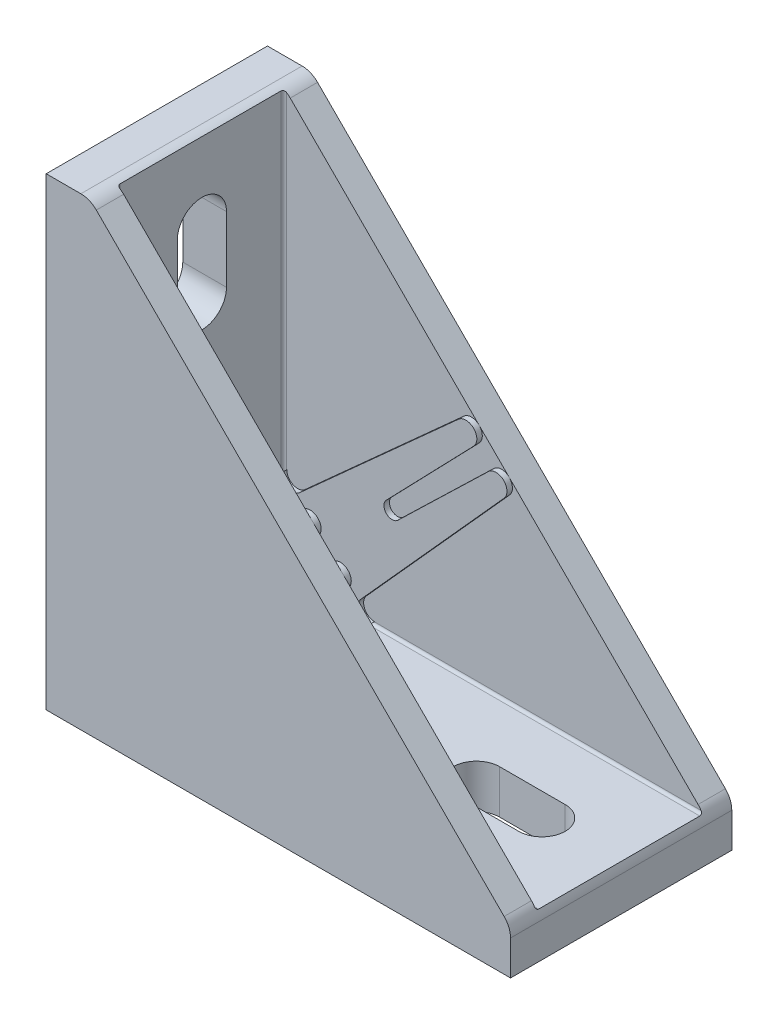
ISO-10303-21;
HEADER;
FILE_DESCRIPTION(('STEP AP214'),'2;1');
FILE_NAME('part.step','',(''),(''),'','','');
FILE_SCHEMA(('AUTOMOTIVE_DESIGN { 1 0 10303 214 1 1 1 1 }'));
ENDSEC;
DATA;
#1=APPLICATION_CONTEXT('core data for automotive mechanical design processes');
#2=APPLICATION_PROTOCOL_DEFINITION('international standard','automotive_design',2000,#1);
#3=PRODUCT_CONTEXT('',#1,'mechanical');
#4=PRODUCT('Part','Part','',(#3));
#5=PRODUCT_RELATED_PRODUCT_CATEGORY('part','',(#4));
#6=PRODUCT_DEFINITION_FORMATION('','',#4);
#7=PRODUCT_DEFINITION_CONTEXT('part definition',#1,'design');
#8=PRODUCT_DEFINITION('design','',#6,#7);
#9=PRODUCT_DEFINITION_SHAPE('','',#8);
#10=(LENGTH_UNIT() NAMED_UNIT(*) SI_UNIT(.MILLI.,.METRE.));
#11=(NAMED_UNIT(*) PLANE_ANGLE_UNIT() SI_UNIT($,.RADIAN.));
#12=(NAMED_UNIT(*) SI_UNIT($,.STERADIAN.) SOLID_ANGLE_UNIT());
#13=UNCERTAINTY_MEASURE_WITH_UNIT(LENGTH_MEASURE(1.E-05),#10,'distance_accuracy_value','');
#14=(GEOMETRIC_REPRESENTATION_CONTEXT(3) GLOBAL_UNCERTAINTY_ASSIGNED_CONTEXT((#13)) GLOBAL_UNIT_ASSIGNED_CONTEXT((#10,
#11,#12)) REPRESENTATION_CONTEXT('',''));
#15=CARTESIAN_POINT('',(0.,0.,0.));
#16=DIRECTION('',(0.,0.,1.));
#17=DIRECTION('',(1.,0.,0.));
#18=AXIS2_PLACEMENT_3D('',#15,#16,#17);
#19=CARTESIAN_POINT('',(49.3312064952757,40.9883948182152,15.25));
#20=DIRECTION('',(-0.743144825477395,0.669130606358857,0.));
#21=DIRECTION('',(-0.669130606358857,-0.743144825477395,0.));
#22=AXIS2_PLACEMENT_3D('',#19,#20,#21);
#23=PLANE('',#22);
#24=DIRECTION('',(0.,0.,1.));
#25=VECTOR('',#24,1.);
#26=CARTESIAN_POINT('',(49.3312064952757,40.9883948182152,15.25));
#27=LINE('',#26,#25);
#28=CARTESIAN_POINT('',(49.3312064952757,40.9883948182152,15.25));
#29=VERTEX_POINT('',#28);
#30=CARTESIAN_POINT('',(49.3312064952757,40.9883948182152,14.25));
#31=VERTEX_POINT('',#30);
#32=EDGE_CURVE('E466',#29,#31,#27,.F.);
#33=ORIENTED_EDGE('',*,*,#32,.F.);
#34=DIRECTION('',(-0.669130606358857,-0.743144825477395,0.));
#35=VECTOR('',#34,1.);
#36=CARTESIAN_POINT('',(49.3312064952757,40.9883948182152,15.25));
#37=LINE('',#36,#35);
#38=CARTESIAN_POINT('',(23.1203244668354,11.8782612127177,15.25));
#39=VERTEX_POINT('',#38);
#40=EDGE_CURVE('E408',#29,#39,#37,.T.);
#41=ORIENTED_EDGE('',*,*,#40,.T.);
#42=DIRECTION('',(0.,0.,1.));
#43=VECTOR('',#42,1.);
#44=CARTESIAN_POINT('',(23.1203244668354,11.8782612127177,15.25));
#45=LINE('',#44,#43);
#46=CARTESIAN_POINT('',(23.1203244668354,11.8782612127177,14.25));
#47=VERTEX_POINT('',#46);
#48=EDGE_CURVE('E404',#39,#47,#45,.F.);
#49=ORIENTED_EDGE('',*,*,#48,.T.);
#50=DIRECTION('',(0.669130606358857,0.743144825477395,0.));
#51=VECTOR('',#50,1.);
#52=CARTESIAN_POINT('',(23.1203244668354,11.8782612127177,14.25));
#53=LINE('',#52,#51);
#54=EDGE_CURVE('E406',#47,#31,#53,.T.);
#55=ORIENTED_EDGE('',*,*,#54,.T.);
#56=EDGE_LOOP('',(#33,#41,#49,#55));
#57=FACE_BOUND('',#56,.T.);
#58=ADVANCED_FACE('F15',(#57),#23,.F.);
#59=CARTESIAN_POINT('',(24.6066141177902,10.54,15.25));
#60=DIRECTION('',(0.,0.,1.));
#61=DIRECTION('',(1.,0.,0.));
#62=AXIS2_PLACEMENT_3D('',#59,#60,#61);
#63=CYLINDRICAL_SURFACE('',#62,2.);
#64=ORIENTED_EDGE('',*,*,#48,.F.);
#65=CARTESIAN_POINT('',(24.6066141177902,10.54,15.25));
#66=DIRECTION('',(0.,0.,1.));
#67=DIRECTION('',(1.,0.,0.));
#68=AXIS2_PLACEMENT_3D('',#65,#66,#67);
#69=CIRCLE('',#68,2.);
#70=CARTESIAN_POINT('',(24.6066141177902,8.54000000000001,15.25));
#71=VERTEX_POINT('',#70);
#72=EDGE_CURVE('E1620',#39,#71,#69,.T.);
#73=ORIENTED_EDGE('',*,*,#72,.T.);
#74=DIRECTION('',(0.,0.,1.));
#75=VECTOR('',#74,1.);
#76=CARTESIAN_POINT('',(24.6066141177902,8.54000000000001,15.25));
#77=LINE('',#76,#75);
#78=CARTESIAN_POINT('',(24.6066141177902,8.54000000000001,14.25));
#79=VERTEX_POINT('',#78);
#80=EDGE_CURVE('E413',#71,#79,#77,.F.);
#81=ORIENTED_EDGE('',*,*,#80,.T.);
#82=CARTESIAN_POINT('',(24.6066141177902,10.54,14.25));
#83=DIRECTION('',(0.,0.,1.));
#84=DIRECTION('',(1.,0.,0.));
#85=AXIS2_PLACEMENT_3D('',#82,#83,#84);
#86=CIRCLE('',#85,2.);
#87=EDGE_CURVE('E421',#79,#47,#86,.F.);
#88=ORIENTED_EDGE('',*,*,#87,.T.);
#89=EDGE_LOOP('',(#64,#73,#81,#88));
#90=FACE_BOUND('',#89,.T.);
#91=ADVANCED_FACE('F428',(#90),#63,.F.);
#92=CARTESIAN_POINT('',(24.6066141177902,8.54000000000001,15.25));
#93=DIRECTION('',(0.,1.,0.));
#94=DIRECTION('',(0.,0.,1.));
#95=AXIS2_PLACEMENT_3D('',#92,#93,#94);
#96=PLANE('',#95);
#97=DIRECTION('',(0.,0.,1.));
#98=VECTOR('',#97,1.);
#99=CARTESIAN_POINT('',(9.99291255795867,8.54000000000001,15.25));
#100=LINE('',#99,#98);
#101=CARTESIAN_POINT('',(9.99291255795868,8.54000000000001,14.25));
#102=VERTEX_POINT('',#101);
#103=CARTESIAN_POINT('',(9.99291255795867,8.54000000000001,14.75));
#104=VERTEX_POINT('',#103);
#105=EDGE_CURVE('E471',#102,#104,#100,.T.);
#106=ORIENTED_EDGE('',*,*,#105,.F.);
#107=DIRECTION('',(1.,0.,0.));
#108=VECTOR('',#107,1.);
#109=CARTESIAN_POINT('',(29.606745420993,8.54000000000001,14.25));
#110=LINE('',#109,#108);
#111=EDGE_CURVE('E429',#102,#79,#110,.T.);
#112=ORIENTED_EDGE('',*,*,#111,.T.);
#113=ORIENTED_EDGE('',*,*,#80,.F.);
#114=DIRECTION('',(1.,0.,0.));
#115=VECTOR('',#114,1.);
#116=CARTESIAN_POINT('',(85.,8.54000000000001,15.25));
#117=LINE('',#116,#115);
#118=CARTESIAN_POINT('',(11.4723637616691,8.54000000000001,15.25));
#119=VERTEX_POINT('',#118);
#120=EDGE_CURVE('E777',#71,#119,#117,.F.);
#121=ORIENTED_EDGE('',*,*,#120,.T.);
#122=CARTESIAN_POINT('',(11.4723637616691,8.54000000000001,15.25));
#123=CARTESIAN_POINT('',(11.417648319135,8.54000000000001,15.2499804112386));
#124=CARTESIAN_POINT('',(11.3629249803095,8.54000000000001,15.2497949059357));
#125=CARTESIAN_POINT('',(11.2529716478,8.54000000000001,15.2485757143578));
#126=CARTESIAN_POINT('',(11.1977417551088,8.54000000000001,15.2475340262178));
#127=CARTESIAN_POINT('',(11.0871092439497,8.54000000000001,15.2440603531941));
#128=CARTESIAN_POINT('',(11.0317067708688,8.54000000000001,15.2416230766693));
#129=CARTESIAN_POINT('',(10.9195968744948,8.54000000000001,15.2345722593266));
#130=CARTESIAN_POINT('',(10.862892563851,8.54000000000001,15.2299043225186));
#131=CARTESIAN_POINT('',(10.7499921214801,8.54000000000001,15.2174596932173));
#132=CARTESIAN_POINT('',(10.6937949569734,8.54000000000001,15.2096927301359));
#133=CARTESIAN_POINT('',(10.5822425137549,8.54000000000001,15.1898535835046));
#134=CARTESIAN_POINT('',(10.5268855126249,8.54000000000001,15.1777919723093));
#135=CARTESIAN_POINT('',(10.4565185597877,8.54000000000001,15.1583519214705));
#136=CARTESIAN_POINT('',(10.4407439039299,8.54000000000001,15.1537209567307));
#137=CARTESIAN_POINT('',(10.4093760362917,8.54000000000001,15.1438941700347));
#138=CARTESIAN_POINT('',(10.3937827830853,8.54000000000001,15.1386984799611));
#139=CARTESIAN_POINT('',(10.3473370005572,8.54000000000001,15.1221774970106));
#140=CARTESIAN_POINT('',(10.3168056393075,8.54000000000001,15.1099148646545));
#141=CARTESIAN_POINT('',(10.2568858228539,8.54000000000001,15.0822007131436));
#142=CARTESIAN_POINT('',(10.2275094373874,8.54000000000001,15.0667227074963));
#143=CARTESIAN_POINT('',(10.1711534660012,8.54000000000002,15.0319049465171));
#144=CARTESIAN_POINT('',(10.1441667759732,8.54000000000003,15.0125772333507));
#145=CARTESIAN_POINT('',(10.1050990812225,8.54000000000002,14.9786362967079));
#146=CARTESIAN_POINT('',(10.0916351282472,8.54000000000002,14.9656217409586));
#147=CARTESIAN_POINT('',(10.0664788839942,8.54000000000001,14.9379376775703));
#148=CARTESIAN_POINT('',(10.054787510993,8.54000000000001,14.9232673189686));
#149=CARTESIAN_POINT('',(10.0336962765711,8.54000000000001,14.8920546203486));
#150=CARTESIAN_POINT('',(10.0243279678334,8.54000000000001,14.87549054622));
#151=CARTESIAN_POINT('',(10.008925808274,8.54000000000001,14.8408988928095));
#152=CARTESIAN_POINT('',(10.0028790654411,8.54000000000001,14.8228772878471));
#153=CARTESIAN_POINT('',(9.99688860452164,8.54000000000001,14.7955105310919));
#154=CARTESIAN_POINT('',(9.99540571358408,8.54000000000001,14.7864871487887));
#155=CARTESIAN_POINT('',(9.99341483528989,8.54000000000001,14.7683120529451));
#156=CARTESIAN_POINT('',(9.99290919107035,8.54000000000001,14.7591600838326));
#157=CARTESIAN_POINT('',(9.99291255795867,8.54000000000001,14.75));
#158=B_SPLINE_CURVE_WITH_KNOTS('',3,(#122,#123,#124,#125,#126,#127,#128,#129,#130,#131,#132,
#133,#134,#135,#136,#137,#138,#139,#140,#141,#142,#143,#144,#145,#146,#147,#148,#149,#150,#151,
#152,#153,#154,#155,#156,#157),.UNSPECIFIED.,.F.,.F.,(4,2,2,2,2,2,2,2,2,2,2,2,2,2,2,2,2,4),(0.,
0.164158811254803,0.329869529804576,0.496212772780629,0.666837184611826,0.836930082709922,
1.00660711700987,1.05591893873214,1.10521926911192,1.20378025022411,1.30318783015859,
1.40228920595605,1.45834555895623,1.51443085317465,1.57124065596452,1.62782837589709,
1.65521421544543,1.6826656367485),.UNSPECIFIED.);
#159=EDGE_CURVE('E432',#119,#104,#158,.T.);
#160=ORIENTED_EDGE('',*,*,#159,.T.);
#161=EDGE_LOOP('',(#106,#112,#113,#121,#160));
#162=FACE_BOUND('',#161,.T.);
#163=ADVANCED_FACE('F851',(#162),#96,.F.);
#164=CARTESIAN_POINT('',(43.7653356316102,46.455600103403,15.25));
#165=DIRECTION('',(-0.719339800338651,0.694658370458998,0.));
#166=DIRECTION('',(-0.694658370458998,-0.719339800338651,0.));
#167=AXIS2_PLACEMENT_3D('',#164,#165,#166);
#168=PLANE('',#167);
#169=DIRECTION('',(0.,0.,1.));
#170=VECTOR('',#169,1.);
#171=CARTESIAN_POINT('',(43.7653356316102,46.455600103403,15.25));
#172=LINE('',#171,#170);
#173=CARTESIAN_POINT('',(43.7653356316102,46.455600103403,15.25));
#174=VERTEX_POINT('',#173);
#175=CARTESIAN_POINT('',(43.7653356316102,46.455600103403,14.25));
#176=VERTEX_POINT('',#175);
#177=EDGE_CURVE('E438',#174,#176,#172,.F.);
#178=ORIENTED_EDGE('',*,*,#177,.F.);
#179=DIRECTION('',(-0.694658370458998,-0.71933980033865,0.));
#180=VECTOR('',#179,1.);
#181=CARTESIAN_POINT('',(43.7653356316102,46.455600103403,15.25));
#182=LINE('',#181,#180);
#183=CARTESIAN_POINT('',(27.7433207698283,29.8643180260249,15.25));
#184=VERTEX_POINT('',#183);
#185=EDGE_CURVE('E767',#174,#184,#182,.T.);
#186=ORIENTED_EDGE('',*,*,#185,.T.);
#187=DIRECTION('',(0.,0.,1.));
#188=VECTOR('',#187,1.);
#189=CARTESIAN_POINT('',(27.7433207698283,29.8643180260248,15.25));
#190=LINE('',#189,#188);
#191=CARTESIAN_POINT('',(27.7433207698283,29.8643180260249,14.25));
#192=VERTEX_POINT('',#191);
#193=EDGE_CURVE('E469',#184,#192,#190,.F.);
#194=ORIENTED_EDGE('',*,*,#193,.T.);
#195=DIRECTION('',(0.694658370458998,0.71933980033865,0.));
#196=VECTOR('',#195,1.);
#197=CARTESIAN_POINT('',(27.7433207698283,29.8643180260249,14.25));
#198=LINE('',#197,#196);
#199=EDGE_CURVE('E545',#192,#176,#198,.T.);
#200=ORIENTED_EDGE('',*,*,#199,.T.);
#201=EDGE_LOOP('',(#178,#186,#194,#200));
#202=FACE_BOUND('',#201,.T.);
#203=ADVANCED_FACE('F848',(#202),#168,.F.);
#204=CARTESIAN_POINT('',(28.8223304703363,28.8223304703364,15.25));
#205=DIRECTION('',(0.,0.,1.));
#206=DIRECTION('',(1.,0.,0.));
#207=AXIS2_PLACEMENT_3D('',#204,#205,#206);
#208=CYLINDRICAL_SURFACE('',#207,1.5);
#209=ORIENTED_EDGE('',*,*,#193,.F.);
#210=CARTESIAN_POINT('',(28.8223304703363,28.8223304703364,15.25));
#211=DIRECTION('',(0.,0.,1.));
#212=DIRECTION('',(1.,0.,0.));
#213=AXIS2_PLACEMENT_3D('',#210,#211,#212);
#214=CIRCLE('',#213,1.5);
#215=CARTESIAN_POINT('',(29.8643180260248,27.7433207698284,15.25));
#216=VERTEX_POINT('',#215);
#217=EDGE_CURVE('E766',#184,#216,#214,.T.);
#218=ORIENTED_EDGE('',*,*,#217,.T.);
#219=DIRECTION('',(0.,0.,1.));
#220=VECTOR('',#219,1.);
#221=CARTESIAN_POINT('',(29.8643180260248,27.7433207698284,15.25));
#222=LINE('',#221,#220);
#223=CARTESIAN_POINT('',(29.8643180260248,27.7433207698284,14.25));
#224=VERTEX_POINT('',#223);
#225=EDGE_CURVE('E467',#216,#224,#222,.F.);
#226=ORIENTED_EDGE('',*,*,#225,.T.);
#227=CARTESIAN_POINT('',(28.8223304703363,28.8223304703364,14.25));
#228=DIRECTION('',(0.,0.,1.));
#229=DIRECTION('',(1.,0.,0.));
#230=AXIS2_PLACEMENT_3D('',#227,#228,#229);
#231=CIRCLE('',#230,1.5);
#232=EDGE_CURVE('E549',#224,#192,#231,.F.);
#233=ORIENTED_EDGE('',*,*,#232,.T.);
#234=EDGE_LOOP('',(#209,#218,#226,#233));
#235=FACE_BOUND('',#234,.T.);
#236=ADVANCED_FACE('F845',(#235),#208,.F.);
#237=CARTESIAN_POINT('',(29.8643180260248,27.7433207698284,15.25));
#238=DIRECTION('',(0.694658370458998,-0.719339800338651,0.));
#239=DIRECTION('',(0.719339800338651,0.694658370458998,0.));
#240=AXIS2_PLACEMENT_3D('',#237,#238,#239);
#241=PLANE('',#240);
#242=ORIENTED_EDGE('',*,*,#225,.F.);
#243=DIRECTION('',(0.71933980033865,0.694658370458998,0.));
#244=VECTOR('',#243,1.);
#245=CARTESIAN_POINT('',(29.8643180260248,27.7433207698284,15.25));
#246=LINE('',#245,#244);
#247=CARTESIAN_POINT('',(46.4556001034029,43.7653356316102,15.25));
#248=VERTEX_POINT('',#247);
#249=EDGE_CURVE('E762',#216,#248,#246,.T.);
#250=ORIENTED_EDGE('',*,*,#249,.T.);
#251=DIRECTION('',(0.,0.,1.));
#252=VECTOR('',#251,1.);
#253=CARTESIAN_POINT('',(46.4556001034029,43.7653356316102,15.25));
#254=LINE('',#253,#252);
#255=CARTESIAN_POINT('',(46.4556001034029,43.7653356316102,14.25));
#256=VERTEX_POINT('',#255);
#257=EDGE_CURVE('E463',#256,#248,#254,.T.);
#258=ORIENTED_EDGE('',*,*,#257,.F.);
#259=DIRECTION('',(-0.71933980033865,-0.694658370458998,0.));
#260=VECTOR('',#259,1.);
#261=CARTESIAN_POINT('',(46.4556001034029,43.7653356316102,14.25));
#262=LINE('',#261,#260);
#263=EDGE_CURVE('E550',#256,#224,#262,.T.);
#264=ORIENTED_EDGE('',*,*,#263,.T.);
#265=EDGE_LOOP('',(#242,#250,#258,#264));
#266=FACE_BOUND('',#265,.T.);
#267=ADVANCED_FACE('F842',(#266),#241,.F.);
#268=CARTESIAN_POINT('',(47.8449168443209,42.3266560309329,15.25));
#269=DIRECTION('',(0.,0.,1.));
#270=DIRECTION('',(1.,0.,0.));
#271=AXIS2_PLACEMENT_3D('',#268,#269,#270);
#272=CYLINDRICAL_SURFACE('',#271,2.);
#273=CARTESIAN_POINT('',(47.8449168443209,42.3266560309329,15.25));
#274=DIRECTION('',(0.,0.,1.));
#275=DIRECTION('',(1.,0.,0.));
#276=AXIS2_PLACEMENT_3D('',#273,#274,#275);
#277=CIRCLE('',#276,2.);
#278=CARTESIAN_POINT('',(49.259130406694,43.740869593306,15.25));
#279=VERTEX_POINT('',#278);
#280=EDGE_CURVE('E562',#279,#29,#277,.F.);
#281=ORIENTED_EDGE('',*,*,#280,.T.);
#282=ORIENTED_EDGE('',*,*,#32,.T.);
#283=CARTESIAN_POINT('',(47.8449168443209,42.3266560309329,14.25));
#284=DIRECTION('',(0.,0.,1.));
#285=DIRECTION('',(1.,0.,0.));
#286=AXIS2_PLACEMENT_3D('',#283,#284,#285);
#287=CIRCLE('',#286,2.);
#288=EDGE_CURVE('E425',#31,#256,#287,.T.);
#289=ORIENTED_EDGE('',*,*,#288,.T.);
#290=ORIENTED_EDGE('',*,*,#257,.T.);
#291=CARTESIAN_POINT('',(47.8449168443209,42.3266560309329,15.25));
#292=DIRECTION('',(0.,0.,1.));
#293=DIRECTION('',(1.,0.,0.));
#294=AXIS2_PLACEMENT_3D('',#291,#292,#293);
#295=CIRCLE('',#294,2.);
#296=EDGE_CURVE('E765',#248,#279,#295,.F.);
#297=ORIENTED_EDGE('',*,*,#296,.T.);
#298=EDGE_LOOP('',(#281,#282,#289,#290,#297));
#299=FACE_BOUND('',#298,.T.);
#300=ADVANCED_FACE('F559',(#299),#272,.T.);
#301=CARTESIAN_POINT('',(8.54000000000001,8.54000000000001,15.25));
#302=DIRECTION('',(1.,0.,0.));
#303=DIRECTION('',(0.,0.,-1.));
#304=AXIS2_PLACEMENT_3D('',#301,#302,#303);
#305=PLANE('',#304);
#306=DIRECTION('',(0.,1.,0.));
#307=VECTOR('',#306,1.);
#308=CARTESIAN_POINT('',(8.54000000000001,8.,15.25));
#309=LINE('',#308,#307);
#310=CARTESIAN_POINT('',(8.54000000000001,11.4723637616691,15.25));
#311=VERTEX_POINT('',#310);
#312=CARTESIAN_POINT('',(8.54000000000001,24.6066141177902,15.25));
#313=VERTEX_POINT('',#312);
#314=EDGE_CURVE('E745',#311,#313,#309,.T.);
#315=ORIENTED_EDGE('',*,*,#314,.T.);
#316=DIRECTION('',(0.,0.,1.));
#317=VECTOR('',#316,1.);
#318=CARTESIAN_POINT('',(8.54000000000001,24.6066141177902,15.25));
#319=LINE('',#318,#317);
#320=CARTESIAN_POINT('',(8.54000000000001,24.6066141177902,14.25));
#321=VERTEX_POINT('',#320);
#322=EDGE_CURVE('E567',#313,#321,#319,.F.);
#323=ORIENTED_EDGE('',*,*,#322,.T.);
#324=DIRECTION('',(0.,1.,0.));
#325=VECTOR('',#324,1.);
#326=CARTESIAN_POINT('',(8.54000000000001,29.606745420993,14.25));
#327=LINE('',#326,#325);
#328=CARTESIAN_POINT('',(8.54000000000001,9.99291255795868,14.25));
#329=VERTEX_POINT('',#328);
#330=EDGE_CURVE('E533',#321,#329,#327,.F.);
#331=ORIENTED_EDGE('',*,*,#330,.T.);
#332=DIRECTION('',(0.,0.,-1.));
#333=VECTOR('',#332,1.);
#334=CARTESIAN_POINT('',(8.54000000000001,9.99291255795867,15.25));
#335=LINE('',#334,#333);
#336=CARTESIAN_POINT('',(8.54000000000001,9.99291255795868,14.75));
#337=VERTEX_POINT('',#336);
#338=EDGE_CURVE('E461',#337,#329,#335,.T.);
#339=ORIENTED_EDGE('',*,*,#338,.F.);
#340=CARTESIAN_POINT('',(8.54000000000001,9.99291255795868,14.75));
#341=CARTESIAN_POINT('',(8.54000000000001,9.99287724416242,14.7650376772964));
#342=CARTESIAN_POINT('',(8.54000000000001,9.99426238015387,14.7800372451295));
#343=CARTESIAN_POINT('',(8.54000000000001,9.99956504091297,14.8094539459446));
#344=CARTESIAN_POINT('',(8.54000000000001,10.0034605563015,14.8238749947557));
#345=CARTESIAN_POINT('',(8.54000000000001,10.013470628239,14.8518617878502));
#346=CARTESIAN_POINT('',(8.54000000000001,10.019578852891,14.865429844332));
#347=CARTESIAN_POINT('',(8.54000000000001,10.0336285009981,14.8916028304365));
#348=CARTESIAN_POINT('',(8.54000000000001,10.0415741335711,14.9042054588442));
#349=CARTESIAN_POINT('',(8.54000000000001,10.0646787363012,14.9363736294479));
#350=CARTESIAN_POINT('',(8.54000000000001,10.0811264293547,14.9550127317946));
#351=CARTESIAN_POINT('',(8.54000000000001,10.1166901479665,14.9895287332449));
#352=CARTESIAN_POINT('',(8.54000000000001,10.1358132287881,15.0053980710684));
#353=CARTESIAN_POINT('',(8.54000000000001,10.1904311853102,15.0454387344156));
#354=CARTESIAN_POINT('',(8.54000000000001,10.2276764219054,15.0672004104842));
#355=CARTESIAN_POINT('',(8.54000000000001,10.3049185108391,15.10528575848));
#356=CARTESIAN_POINT('',(8.54000000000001,10.3449284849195,15.1215809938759));
#357=CARTESIAN_POINT('',(8.54000000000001,10.4421491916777,15.1554793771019));
#358=CARTESIAN_POINT('',(8.54000000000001,10.5000227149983,15.1711468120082));
#359=CARTESIAN_POINT('',(8.54000000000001,10.6168467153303,15.1968391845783));
#360=CARTESIAN_POINT('',(8.54000000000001,10.6757960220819,15.2068699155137));
#361=CARTESIAN_POINT('',(8.54000000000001,10.7946175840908,15.2230154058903));
#362=CARTESIAN_POINT('',(8.54000000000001,10.8544933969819,15.2291028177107));
#363=CARTESIAN_POINT('',(8.54000000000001,10.9744693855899,15.2384752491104));
#364=CARTESIAN_POINT('',(8.54000000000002,11.0345696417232,15.2417591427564));
#365=CARTESIAN_POINT('',(8.54000000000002,11.1579654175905,15.2465979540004));
#366=CARTESIAN_POINT('',(8.54000000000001,11.2212643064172,15.2480539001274));
#367=CARTESIAN_POINT('',(8.54000000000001,11.3471686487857,15.2497309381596));
#368=CARTESIAN_POINT('',(8.54000000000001,11.4097738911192,15.2499657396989));
#369=CARTESIAN_POINT('',(8.54000000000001,11.4723637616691,15.25));
#370=B_SPLINE_CURVE_WITH_KNOTS('',3,(#340,#341,#342,#343,#344,#345,#346,#347,#348,#349,#350,
#351,#352,#353,#354,#355,#356,#357,#358,#359,#360,#361,#362,#363,#364,#365,#366,#367,#368,#369),
.UNSPECIFIED.,.F.,.F.,(4,2,2,2,2,2,2,2,2,2,2,2,2,2,4),(0.,0.0449887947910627,0.0895884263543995,
0.134061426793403,0.178637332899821,0.252781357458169,0.327124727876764,0.455805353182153,
0.585145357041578,0.764555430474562,0.943780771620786,1.12423612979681,1.30476392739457,
1.49469530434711,1.68248967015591),.UNSPECIFIED.);
#371=EDGE_CURVE('E532',#337,#311,#370,.T.);
#372=ORIENTED_EDGE('',*,*,#371,.T.);
#373=EDGE_LOOP('',(#315,#323,#331,#339,#372));
#374=FACE_BOUND('',#373,.T.);
#375=ADVANCED_FACE('F833',(#374),#305,.F.);
#376=CARTESIAN_POINT('',(10.54,24.6066141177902,15.25));
#377=DIRECTION('',(0.,0.,1.));
#378=DIRECTION('',(1.,0.,0.));
#379=AXIS2_PLACEMENT_3D('',#376,#377,#378);
#380=CYLINDRICAL_SURFACE('',#379,2.);
#381=ORIENTED_EDGE('',*,*,#322,.F.);
#382=CARTESIAN_POINT('',(10.54,24.6066141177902,15.25));
#383=DIRECTION('',(0.,0.,1.));
#384=DIRECTION('',(1.,0.,0.));
#385=AXIS2_PLACEMENT_3D('',#382,#383,#384);
#386=CIRCLE('',#385,2.);
#387=CARTESIAN_POINT('',(11.8782612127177,23.1203244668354,15.25));
#388=VERTEX_POINT('',#387);
#389=EDGE_CURVE('E744',#313,#388,#386,.T.);
#390=ORIENTED_EDGE('',*,*,#389,.T.);
#391=DIRECTION('',(0.,0.,1.));
#392=VECTOR('',#391,1.);
#393=CARTESIAN_POINT('',(11.8782612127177,23.1203244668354,15.25));
#394=LINE('',#393,#392);
#395=CARTESIAN_POINT('',(11.8782612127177,23.1203244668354,14.25));
#396=VERTEX_POINT('',#395);
#397=EDGE_CURVE('E457',#388,#396,#394,.F.);
#398=ORIENTED_EDGE('',*,*,#397,.T.);
#399=CARTESIAN_POINT('',(10.54,24.6066141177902,14.25));
#400=DIRECTION('',(0.,0.,1.));
#401=DIRECTION('',(1.,0.,0.));
#402=AXIS2_PLACEMENT_3D('',#399,#400,#401);
#403=CIRCLE('',#402,2.);
#404=EDGE_CURVE('E539',#396,#321,#403,.F.);
#405=ORIENTED_EDGE('',*,*,#404,.T.);
#406=EDGE_LOOP('',(#381,#390,#398,#405));
#407=FACE_BOUND('',#406,.T.);
#408=ADVANCED_FACE('F838',(#407),#380,.F.);
#409=CARTESIAN_POINT('',(11.8782612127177,23.1203244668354,15.25));
#410=DIRECTION('',(0.669130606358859,-0.743144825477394,0.));
#411=DIRECTION('',(0.743144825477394,0.669130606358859,0.));
#412=AXIS2_PLACEMENT_3D('',#409,#410,#411);
#413=PLANE('',#412);
#414=ORIENTED_EDGE('',*,*,#397,.F.);
#415=DIRECTION('',(0.743144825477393,0.669130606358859,0.));
#416=VECTOR('',#415,1.);
#417=CARTESIAN_POINT('',(11.8782612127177,23.1203244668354,15.25));
#418=LINE('',#417,#416);
#419=CARTESIAN_POINT('',(40.9883948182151,49.3312064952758,15.25));
#420=VERTEX_POINT('',#419);
#421=EDGE_CURVE('E734',#388,#420,#418,.T.);
#422=ORIENTED_EDGE('',*,*,#421,.T.);
#423=DIRECTION('',(0.,0.,1.));
#424=VECTOR('',#423,1.);
#425=CARTESIAN_POINT('',(40.9883948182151,49.3312064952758,15.25));
#426=LINE('',#425,#424);
#427=CARTESIAN_POINT('',(40.9883948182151,49.3312064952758,14.25));
#428=VERTEX_POINT('',#427);
#429=EDGE_CURVE('E447',#428,#420,#426,.T.);
#430=ORIENTED_EDGE('',*,*,#429,.F.);
#431=DIRECTION('',(-0.743144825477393,-0.669130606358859,0.));
#432=VECTOR('',#431,1.);
#433=CARTESIAN_POINT('',(40.9883948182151,49.3312064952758,14.25));
#434=LINE('',#433,#432);
#435=EDGE_CURVE('E540',#428,#396,#434,.T.);
#436=ORIENTED_EDGE('',*,*,#435,.T.);
#437=EDGE_LOOP('',(#414,#422,#430,#436));
#438=FACE_BOUND('',#437,.T.);
#439=ADVANCED_FACE('F901',(#438),#413,.F.);
#440=CARTESIAN_POINT('',(42.3266560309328,47.844916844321,15.25));
#441=DIRECTION('',(0.,0.,1.));
#442=DIRECTION('',(1.,0.,0.));
#443=AXIS2_PLACEMENT_3D('',#440,#441,#442);
#444=CYLINDRICAL_SURFACE('',#443,2.);
#445=CARTESIAN_POINT('',(42.3266560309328,47.844916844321,15.25));
#446=DIRECTION('',(0.,0.,1.));
#447=DIRECTION('',(1.,0.,0.));
#448=AXIS2_PLACEMENT_3D('',#445,#446,#447);
#449=CIRCLE('',#448,2.);
#450=CARTESIAN_POINT('',(43.7408695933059,49.2591304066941,15.25));
#451=VERTEX_POINT('',#450);
#452=EDGE_CURVE('E749',#451,#174,#449,.F.);
#453=ORIENTED_EDGE('',*,*,#452,.T.);
#454=ORIENTED_EDGE('',*,*,#177,.T.);
#455=CARTESIAN_POINT('',(42.3266560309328,47.844916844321,14.25));
#456=DIRECTION('',(0.,0.,1.));
#457=DIRECTION('',(1.,0.,0.));
#458=AXIS2_PLACEMENT_3D('',#455,#456,#457);
#459=CIRCLE('',#458,2.);
#460=EDGE_CURVE('E544',#176,#428,#459,.T.);
#461=ORIENTED_EDGE('',*,*,#460,.T.);
#462=ORIENTED_EDGE('',*,*,#429,.T.);
#463=CARTESIAN_POINT('',(42.3266560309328,47.844916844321,15.25));
#464=DIRECTION('',(0.,0.,1.));
#465=DIRECTION('',(1.,0.,0.));
#466=AXIS2_PLACEMENT_3D('',#463,#464,#465);
#467=CIRCLE('',#466,2.);
#468=EDGE_CURVE('E743',#420,#451,#467,.F.);
#469=ORIENTED_EDGE('',*,*,#468,.T.);
#470=EDGE_LOOP('',(#453,#454,#461,#462,#469));
#471=FACE_BOUND('',#470,.T.);
#472=ADVANCED_FACE('F493',(#471),#444,.T.);
#473=CARTESIAN_POINT('',(12.,12.,14.75));
#474=DIRECTION('',(0.,0.,-1.));
#475=DIRECTION('',(-1.,0.,0.));
#476=AXIS2_PLACEMENT_3D('',#473,#474,#475);
#477=TOROIDAL_SURFACE('',#476,3.5,0.5);
#478=CARTESIAN_POINT('',(12.,12.,15.25));
#479=DIRECTION('',(0.,0.,1.));
#480=DIRECTION('',(-0.150753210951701,-0.988571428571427,0.));
#481=AXIS2_PLACEMENT_3D('',#478,#479,#480);
#482=CIRCLE('',#481,3.5);
#483=CARTESIAN_POINT('',(12.,8.50000000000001,15.25));
#484=VERTEX_POINT('',#483);
#485=EDGE_CURVE('E477',#119,#484,#482,.T.);
#486=ORIENTED_EDGE('',*,*,#485,.T.);
#487=CARTESIAN_POINT('',(12.,8.50000000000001,14.75));
#488=DIRECTION('',(1.,0.,0.));
#489=DIRECTION('',(0.,0.,-1.));
#490=AXIS2_PLACEMENT_3D('',#487,#488,#489);
#491=CIRCLE('',#490,0.5);
#492=CARTESIAN_POINT('',(12.,8.00000000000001,14.75));
#493=VERTEX_POINT('',#492);
#494=EDGE_CURVE('E583',#484,#493,#491,.T.);
#495=ORIENTED_EDGE('',*,*,#494,.T.);
#496=CARTESIAN_POINT('',(12.,12.,14.75));
#497=DIRECTION('',(0.,0.,1.));
#498=DIRECTION('',(1.,0.,0.));
#499=AXIS2_PLACEMENT_3D('',#496,#497,#498);
#500=CIRCLE('',#499,4.);
#501=EDGE_CURVE('E1556',#493,#104,#500,.F.);
#502=ORIENTED_EDGE('',*,*,#501,.T.);
#503=ORIENTED_EDGE('',*,*,#159,.F.);
#504=EDGE_LOOP('',(#486,#495,#502,#503));
#505=FACE_BOUND('',#504,.T.);
#506=ADVANCED_FACE('F482',(#505),#477,.F.);
#507=CARTESIAN_POINT('',(29.606745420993,29.606745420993,14.25));
#508=DIRECTION('',(0.,0.,1.));
#509=DIRECTION('',(1.,0.,0.));
#510=AXIS2_PLACEMENT_3D('',#507,#508,#509);
#511=PLANE('',#510);
#512=ORIENTED_EDGE('',*,*,#330,.F.);
#513=ORIENTED_EDGE('',*,*,#404,.F.);
#514=ORIENTED_EDGE('',*,*,#435,.F.);
#515=ORIENTED_EDGE('',*,*,#460,.F.);
#516=ORIENTED_EDGE('',*,*,#199,.F.);
#517=ORIENTED_EDGE('',*,*,#232,.F.);
#518=ORIENTED_EDGE('',*,*,#263,.F.);
#519=ORIENTED_EDGE('',*,*,#288,.F.);
#520=ORIENTED_EDGE('',*,*,#54,.F.);
#521=ORIENTED_EDGE('',*,*,#87,.F.);
#522=ORIENTED_EDGE('',*,*,#111,.F.);
#523=CARTESIAN_POINT('',(12.,12.,14.25));
#524=DIRECTION('',(0.,0.,1.));
#525=DIRECTION('',(1.,0.,0.));
#526=AXIS2_PLACEMENT_3D('',#523,#524,#525);
#527=CIRCLE('',#526,4.);
#528=EDGE_CURVE('E711',#102,#329,#527,.F.);
#529=ORIENTED_EDGE('',*,*,#528,.T.);
#530=EDGE_LOOP('',(#512,#513,#514,#515,#516,#517,#518,#519,#520,#521,#522,#529));
#531=FACE_BOUND('',#530,.T.);
#532=ADVANCED_FACE('F419',(#531),#511,.F.);
#533=CARTESIAN_POINT('',(12.,12.,14.75));
#534=DIRECTION('',(0.,0.,-1.));
#535=DIRECTION('',(-1.,0.,0.));
#536=AXIS2_PLACEMENT_3D('',#533,#534,#535);
#537=TOROIDAL_SURFACE('',#536,3.5,0.5);
#538=CARTESIAN_POINT('',(12.,12.,14.75));
#539=DIRECTION('',(0.,0.,1.));
#540=DIRECTION('',(1.,0.,0.));
#541=AXIS2_PLACEMENT_3D('',#538,#539,#540);
#542=CIRCLE('',#541,4.);
#543=CARTESIAN_POINT('',(8.00000000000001,12.,14.75));
#544=VERTEX_POINT('',#543);
#545=EDGE_CURVE('E1545',#337,#544,#542,.F.);
#546=ORIENTED_EDGE('',*,*,#545,.T.);
#547=CARTESIAN_POINT('',(8.50000000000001,12.,14.75));
#548=DIRECTION('',(0.,1.,0.));
#549=DIRECTION('',(-1.,0.,0.));
#550=AXIS2_PLACEMENT_3D('',#547,#548,#549);
#551=CIRCLE('',#550,0.5);
#552=CARTESIAN_POINT('',(8.50000000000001,12.,15.25));
#553=VERTEX_POINT('',#552);
#554=EDGE_CURVE('E528',#553,#544,#551,.F.);
#555=ORIENTED_EDGE('',*,*,#554,.F.);
#556=CARTESIAN_POINT('',(12.,12.,15.25));
#557=DIRECTION('',(0.,0.,1.));
#558=DIRECTION('',(-1.,0.,0.));
#559=AXIS2_PLACEMENT_3D('',#556,#557,#558);
#560=CIRCLE('',#559,3.5);
#561=EDGE_CURVE('E505',#553,#311,#560,.T.);
#562=ORIENTED_EDGE('',*,*,#561,.T.);
#563=ORIENTED_EDGE('',*,*,#371,.F.);
#564=EDGE_LOOP('',(#546,#555,#562,#563));
#565=FACE_BOUND('',#564,.T.);
#566=ADVANCED_FACE('F509',(#565),#537,.F.);
#567=CARTESIAN_POINT('',(12.,12.,-14.75));
#568=DIRECTION('',(0.,0.,1.));
#569=DIRECTION('',(1.,0.,0.));
#570=AXIS2_PLACEMENT_3D('',#567,#568,#569);
#571=TOROIDAL_SURFACE('',#570,3.5,0.5);
#572=CARTESIAN_POINT('',(12.,12.,-15.25));
#573=DIRECTION('',(0.,0.,-1.));
#574=DIRECTION('',(-0.988571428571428,-0.150753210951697,0.));
#575=AXIS2_PLACEMENT_3D('',#572,#573,#574);
#576=CIRCLE('',#575,3.5);
#577=CARTESIAN_POINT('',(8.50000000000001,12.,-15.25));
#578=VERTEX_POINT('',#577);
#579=CARTESIAN_POINT('',(8.54000000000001,11.4723637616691,-15.25));
#580=VERTEX_POINT('',#579);
#581=EDGE_CURVE('E825',#578,#580,#576,.F.);
#582=ORIENTED_EDGE('',*,*,#581,.F.);
#583=CARTESIAN_POINT('',(8.50000000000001,12.,-14.75));
#584=DIRECTION('',(0.,1.,0.));
#585=DIRECTION('',(0.,0.,1.));
#586=AXIS2_PLACEMENT_3D('',#583,#584,#585);
#587=CIRCLE('',#586,0.5);
#588=CARTESIAN_POINT('',(8.00000000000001,12.,-14.75));
#589=VERTEX_POINT('',#588);
#590=EDGE_CURVE('E710',#578,#589,#587,.T.);
#591=ORIENTED_EDGE('',*,*,#590,.T.);
#592=CARTESIAN_POINT('',(12.,12.,-14.75));
#593=DIRECTION('',(0.,0.,1.));
#594=DIRECTION('',(1.,0.,0.));
#595=AXIS2_PLACEMENT_3D('',#592,#593,#594);
#596=CIRCLE('',#595,4.);
#597=CARTESIAN_POINT('',(8.54000000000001,9.99291255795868,-14.75));
#598=VERTEX_POINT('',#597);
#599=EDGE_CURVE('E634',#589,#598,#596,.T.);
#600=ORIENTED_EDGE('',*,*,#599,.T.);
#601=CARTESIAN_POINT('',(8.54000000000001,11.4723637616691,-15.25));
#602=CARTESIAN_POINT('',(8.54000000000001,11.4176483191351,-15.2499804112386));
#603=CARTESIAN_POINT('',(8.54000000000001,11.3629249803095,-15.2497949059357));
#604=CARTESIAN_POINT('',(8.54000000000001,11.2529716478,-15.2485757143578));
#605=CARTESIAN_POINT('',(8.54000000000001,11.1977417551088,-15.2475340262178));
#606=CARTESIAN_POINT('',(8.54000000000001,11.0871092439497,-15.2440603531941));
#607=CARTESIAN_POINT('',(8.54000000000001,11.0317067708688,-15.2416230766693));
#608=CARTESIAN_POINT('',(8.54000000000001,10.9195968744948,-15.2345722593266));
#609=CARTESIAN_POINT('',(8.54000000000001,10.862892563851,-15.2299043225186));
#610=CARTESIAN_POINT('',(8.54000000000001,10.7499921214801,-15.2174596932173));
#611=CARTESIAN_POINT('',(8.54000000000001,10.6937949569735,-15.2096927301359));
#612=CARTESIAN_POINT('',(8.54000000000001,10.582242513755,-15.1898535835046));
#613=CARTESIAN_POINT('',(8.54000000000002,10.5268855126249,-15.1777919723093));
#614=CARTESIAN_POINT('',(8.54000000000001,10.4565185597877,-15.1583519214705));
#615=CARTESIAN_POINT('',(8.54000000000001,10.4407439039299,-15.1537209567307));
#616=CARTESIAN_POINT('',(8.54000000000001,10.4093760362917,-15.1438941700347));
#617=CARTESIAN_POINT('',(8.54000000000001,10.3937827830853,-15.1386984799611));
#618=CARTESIAN_POINT('',(8.54000000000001,10.3473370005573,-15.1221774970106));
#619=CARTESIAN_POINT('',(8.54000000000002,10.3168056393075,-15.1099148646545));
#620=CARTESIAN_POINT('',(8.54000000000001,10.2568858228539,-15.0822007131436));
#621=CARTESIAN_POINT('',(8.54,10.2275094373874,-15.0667227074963));
#622=CARTESIAN_POINT('',(8.54000000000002,10.1711534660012,-15.0319049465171));
#623=CARTESIAN_POINT('',(8.54000000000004,10.1441667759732,-15.0125772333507));
#624=CARTESIAN_POINT('',(8.54000000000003,10.1050990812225,-14.9786362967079));
#625=CARTESIAN_POINT('',(8.54000000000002,10.0916351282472,-14.9656217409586));
#626=CARTESIAN_POINT('',(8.54000000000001,10.0664788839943,-14.9379376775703));
#627=CARTESIAN_POINT('',(8.54000000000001,10.054787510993,-14.9232673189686));
#628=CARTESIAN_POINT('',(8.54000000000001,10.0336962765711,-14.8920546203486));
#629=CARTESIAN_POINT('',(8.54000000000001,10.0243279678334,-14.87549054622));
#630=CARTESIAN_POINT('',(8.54000000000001,10.008925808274,-14.8408988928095));
#631=CARTESIAN_POINT('',(8.54000000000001,10.0028790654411,-14.8228772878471));
#632=CARTESIAN_POINT('',(8.54000000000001,9.99688860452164,-14.7955105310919));
#633=CARTESIAN_POINT('',(8.54000000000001,9.99540571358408,-14.7864871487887));
#634=CARTESIAN_POINT('',(8.54000000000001,9.99341483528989,-14.7683120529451));
#635=CARTESIAN_POINT('',(8.54000000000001,9.99290919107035,-14.7591600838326));
#636=CARTESIAN_POINT('',(8.54000000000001,9.99291255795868,-14.75));
#637=B_SPLINE_CURVE_WITH_KNOTS('',3,(#601,#602,#603,#604,#605,#606,#607,#608,#609,#610,#611,
#612,#613,#614,#615,#616,#617,#618,#619,#620,#621,#622,#623,#624,#625,#626,#627,#628,#629,#630,
#631,#632,#633,#634,#635,#636),.UNSPECIFIED.,.F.,.F.,(4,2,2,2,2,2,2,2,2,2,2,2,2,2,2,2,2,4),(0.,
0.164158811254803,0.329869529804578,0.496212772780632,0.666837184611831,0.836930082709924,
1.00660711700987,1.05591893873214,1.10521926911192,1.20378025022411,1.30318783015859,
1.40228920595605,1.45834555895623,1.51443085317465,1.57124065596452,1.6278283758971,
1.65521421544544,1.68266563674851),.UNSPECIFIED.);
#638=EDGE_CURVE('E637',#580,#598,#637,.T.);
#639=ORIENTED_EDGE('',*,*,#638,.F.);
#640=EDGE_LOOP('',(#582,#591,#600,#639));
#641=FACE_BOUND('',#640,.T.);
#642=ADVANCED_FACE('F519',(#641),#571,.F.);
#643=CARTESIAN_POINT('',(29.606745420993,29.606745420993,-14.25));
#644=DIRECTION('',(0.,0.,1.));
#645=DIRECTION('',(1.,0.,0.));
#646=AXIS2_PLACEMENT_3D('',#643,#644,#645);
#647=PLANE('',#646);
#648=CARTESIAN_POINT('',(10.54,24.6066141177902,-14.25));
#649=DIRECTION('',(0.,0.,1.));
#650=DIRECTION('',(1.,0.,0.));
#651=AXIS2_PLACEMENT_3D('',#648,#649,#650);
#652=CIRCLE('',#651,2.);
#653=CARTESIAN_POINT('',(11.8782612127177,23.1203244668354,-14.25));
#654=VERTEX_POINT('',#653);
#655=CARTESIAN_POINT('',(8.54000000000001,24.6066141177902,-14.25));
#656=VERTEX_POINT('',#655);
#657=EDGE_CURVE('E643',#654,#656,#652,.F.);
#658=ORIENTED_EDGE('',*,*,#657,.T.);
#659=DIRECTION('',(0.,1.,0.));
#660=VECTOR('',#659,1.);
#661=CARTESIAN_POINT('',(8.54000000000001,8.54000000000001,-14.25));
#662=LINE('',#661,#660);
#663=CARTESIAN_POINT('',(8.54000000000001,9.99291255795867,-14.25));
#664=VERTEX_POINT('',#663);
#665=EDGE_CURVE('E635',#664,#656,#662,.T.);
#666=ORIENTED_EDGE('',*,*,#665,.F.);
#667=CARTESIAN_POINT('',(12.,12.,-14.25));
#668=DIRECTION('',(0.,0.,1.));
#669=DIRECTION('',(1.,0.,0.));
#670=AXIS2_PLACEMENT_3D('',#667,#668,#669);
#671=CIRCLE('',#670,4.);
#672=CARTESIAN_POINT('',(9.99291255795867,8.54000000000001,-14.25));
#673=VERTEX_POINT('',#672);
#674=EDGE_CURVE('E626',#664,#673,#671,.T.);
#675=ORIENTED_EDGE('',*,*,#674,.T.);
#676=DIRECTION('',(1.,0.,0.));
#677=VECTOR('',#676,1.);
#678=CARTESIAN_POINT('',(24.6066141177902,8.54000000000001,-14.25));
#679=LINE('',#678,#677);
#680=CARTESIAN_POINT('',(24.6066141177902,8.54000000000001,-14.25));
#681=VERTEX_POINT('',#680);
#682=EDGE_CURVE('E627',#681,#673,#679,.F.);
#683=ORIENTED_EDGE('',*,*,#682,.F.);
#684=CARTESIAN_POINT('',(24.6066141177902,10.54,-14.25));
#685=DIRECTION('',(0.,0.,1.));
#686=DIRECTION('',(1.,0.,0.));
#687=AXIS2_PLACEMENT_3D('',#684,#685,#686);
#688=CIRCLE('',#687,2.);
#689=CARTESIAN_POINT('',(23.1203244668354,11.8782612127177,-14.25));
#690=VERTEX_POINT('',#689);
#691=EDGE_CURVE('E578',#681,#690,#688,.F.);
#692=ORIENTED_EDGE('',*,*,#691,.T.);
#693=DIRECTION('',(0.669130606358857,0.743144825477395,0.));
#694=VECTOR('',#693,1.);
#695=CARTESIAN_POINT('',(49.3312064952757,40.9883948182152,-14.25));
#696=LINE('',#695,#694);
#697=CARTESIAN_POINT('',(49.3312064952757,40.9883948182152,-14.25));
#698=VERTEX_POINT('',#697);
#699=EDGE_CURVE('E574',#698,#690,#696,.F.);
#700=ORIENTED_EDGE('',*,*,#699,.F.);
#701=CARTESIAN_POINT('',(47.8449168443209,42.3266560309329,-14.25));
#702=DIRECTION('',(0.,0.,1.));
#703=DIRECTION('',(1.,0.,0.));
#704=AXIS2_PLACEMENT_3D('',#701,#702,#703);
#705=CIRCLE('',#704,2.);
#706=CARTESIAN_POINT('',(46.4556001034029,43.7653356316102,-14.25));
#707=VERTEX_POINT('',#706);
#708=EDGE_CURVE('E807',#707,#698,#705,.F.);
#709=ORIENTED_EDGE('',*,*,#708,.F.);
#710=DIRECTION('',(-0.719339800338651,-0.694658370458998,0.));
#711=VECTOR('',#710,1.);
#712=CARTESIAN_POINT('',(29.8643180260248,27.7433207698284,-14.25));
#713=LINE('',#712,#711);
#714=CARTESIAN_POINT('',(29.8643180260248,27.7433207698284,-14.25));
#715=VERTEX_POINT('',#714);
#716=EDGE_CURVE('E569',#715,#707,#713,.F.);
#717=ORIENTED_EDGE('',*,*,#716,.F.);
#718=CARTESIAN_POINT('',(28.8223304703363,28.8223304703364,-14.25));
#719=DIRECTION('',(0.,0.,1.));
#720=DIRECTION('',(1.,0.,0.));
#721=AXIS2_PLACEMENT_3D('',#718,#719,#720);
#722=CIRCLE('',#721,1.5);
#723=CARTESIAN_POINT('',(27.7433207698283,29.8643180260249,-14.25));
#724=VERTEX_POINT('',#723);
#725=EDGE_CURVE('E588',#715,#724,#722,.F.);
#726=ORIENTED_EDGE('',*,*,#725,.T.);
#727=DIRECTION('',(0.694658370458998,0.719339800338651,0.));
#728=VECTOR('',#727,1.);
#729=CARTESIAN_POINT('',(43.7653356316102,46.455600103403,-14.25));
#730=LINE('',#729,#728);
#731=CARTESIAN_POINT('',(43.7653356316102,46.455600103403,-14.25));
#732=VERTEX_POINT('',#731);
#733=EDGE_CURVE('E584',#732,#724,#730,.F.);
#734=ORIENTED_EDGE('',*,*,#733,.F.);
#735=CARTESIAN_POINT('',(42.3266560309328,47.844916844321,-14.25));
#736=DIRECTION('',(0.,0.,1.));
#737=DIRECTION('',(1.,0.,0.));
#738=AXIS2_PLACEMENT_3D('',#735,#736,#737);
#739=CIRCLE('',#738,2.);
#740=CARTESIAN_POINT('',(40.9883948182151,49.3312064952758,-14.25));
#741=VERTEX_POINT('',#740);
#742=EDGE_CURVE('E1596',#741,#732,#739,.F.);
#743=ORIENTED_EDGE('',*,*,#742,.F.);
#744=DIRECTION('',(-0.743144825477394,-0.669130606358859,0.));
#745=VECTOR('',#744,1.);
#746=CARTESIAN_POINT('',(11.8782612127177,23.1203244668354,-14.25));
#747=LINE('',#746,#745);
#748=EDGE_CURVE('E579',#654,#741,#747,.F.);
#749=ORIENTED_EDGE('',*,*,#748,.F.);
#750=EDGE_LOOP('',(#658,#666,#675,#683,#692,#700,#709,#717,#726,#734,#743,#749));
#751=FACE_BOUND('',#750,.T.);
#752=ADVANCED_FACE('F613',(#751),#647,.T.);
#753=CARTESIAN_POINT('',(12.,12.,-14.75));
#754=DIRECTION('',(0.,0.,1.));
#755=DIRECTION('',(1.,0.,0.));
#756=AXIS2_PLACEMENT_3D('',#753,#754,#755);
#757=TOROIDAL_SURFACE('',#756,3.5,0.5);
#758=CARTESIAN_POINT('',(12.,12.,-14.75));
#759=DIRECTION('',(0.,0.,1.));
#760=DIRECTION('',(1.,0.,0.));
#761=AXIS2_PLACEMENT_3D('',#758,#759,#760);
#762=CIRCLE('',#761,4.);
#763=CARTESIAN_POINT('',(9.99291255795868,8.54000000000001,-14.75));
#764=VERTEX_POINT('',#763);
#765=CARTESIAN_POINT('',(12.,8.,-14.75));
#766=VERTEX_POINT('',#765);
#767=EDGE_CURVE('E625',#764,#766,#762,.T.);
#768=ORIENTED_EDGE('',*,*,#767,.T.);
#769=CARTESIAN_POINT('',(12.,8.5,-14.75));
#770=DIRECTION('',(-1.,0.,0.));
#771=DIRECTION('',(0.,0.,1.));
#772=AXIS2_PLACEMENT_3D('',#769,#770,#771);
#773=CIRCLE('',#772,0.5);
#774=CARTESIAN_POINT('',(12.,8.5,-15.25));
#775=VERTEX_POINT('',#774);
#776=EDGE_CURVE('E804',#766,#775,#773,.F.);
#777=ORIENTED_EDGE('',*,*,#776,.T.);
#778=CARTESIAN_POINT('',(12.,12.,-15.25));
#779=DIRECTION('',(0.,0.,-1.));
#780=DIRECTION('',(0.,-1.,0.));
#781=AXIS2_PLACEMENT_3D('',#778,#779,#780);
#782=CIRCLE('',#781,3.5);
#783=CARTESIAN_POINT('',(11.4723637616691,8.54000000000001,-15.25));
#784=VERTEX_POINT('',#783);
#785=EDGE_CURVE('E594',#784,#775,#782,.F.);
#786=ORIENTED_EDGE('',*,*,#785,.F.);
#787=CARTESIAN_POINT('',(9.99291255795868,8.54000000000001,-14.75));
#788=CARTESIAN_POINT('',(9.99287724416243,8.54000000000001,-14.7650376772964));
#789=CARTESIAN_POINT('',(9.99426238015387,8.54000000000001,-14.7800372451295));
#790=CARTESIAN_POINT('',(9.99956504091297,8.54000000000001,-14.8094539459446));
#791=CARTESIAN_POINT('',(10.0034605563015,8.54000000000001,-14.8238749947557));
#792=CARTESIAN_POINT('',(10.013470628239,8.54000000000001,-14.8518617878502));
#793=CARTESIAN_POINT('',(10.019578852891,8.54000000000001,-14.8654298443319));
#794=CARTESIAN_POINT('',(10.0336285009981,8.54000000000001,-14.8916028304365));
#795=CARTESIAN_POINT('',(10.0415741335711,8.54000000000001,-14.9042054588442));
#796=CARTESIAN_POINT('',(10.0646787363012,8.54000000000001,-14.9363736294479));
#797=CARTESIAN_POINT('',(10.0811264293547,8.54000000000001,-14.9550127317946));
#798=CARTESIAN_POINT('',(10.1166901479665,8.54000000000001,-14.9895287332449));
#799=CARTESIAN_POINT('',(10.1358132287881,8.54000000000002,-15.0053980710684));
#800=CARTESIAN_POINT('',(10.1904311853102,8.54000000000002,-15.0454387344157));
#801=CARTESIAN_POINT('',(10.2276764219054,8.54000000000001,-15.0672004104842));
#802=CARTESIAN_POINT('',(10.3049185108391,8.54000000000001,-15.10528575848));
#803=CARTESIAN_POINT('',(10.3449284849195,8.54000000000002,-15.1215809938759));
#804=CARTESIAN_POINT('',(10.4421491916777,8.54000000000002,-15.1554793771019));
#805=CARTESIAN_POINT('',(10.5000227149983,8.54000000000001,-15.1711468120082));
#806=CARTESIAN_POINT('',(10.6168467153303,8.54000000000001,-15.1968391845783));
#807=CARTESIAN_POINT('',(10.6757960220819,8.54000000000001,-15.2068699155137));
#808=CARTESIAN_POINT('',(10.7946175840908,8.54000000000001,-15.2230154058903));
#809=CARTESIAN_POINT('',(10.8544933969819,8.54000000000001,-15.2291028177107));
#810=CARTESIAN_POINT('',(10.9744693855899,8.54000000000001,-15.2384752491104));
#811=CARTESIAN_POINT('',(11.0345696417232,8.54000000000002,-15.2417591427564));
#812=CARTESIAN_POINT('',(11.1579654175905,8.54000000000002,-15.2465979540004));
#813=CARTESIAN_POINT('',(11.2212643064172,8.54000000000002,-15.2480539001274));
#814=CARTESIAN_POINT('',(11.3471686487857,8.54000000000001,-15.2497309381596));
#815=CARTESIAN_POINT('',(11.4097738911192,8.54,-15.2499657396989));
#816=CARTESIAN_POINT('',(11.4723637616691,8.54000000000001,-15.25));
#817=B_SPLINE_CURVE_WITH_KNOTS('',3,(#787,#788,#789,#790,#791,#792,#793,#794,#795,#796,#797,
#798,#799,#800,#801,#802,#803,#804,#805,#806,#807,#808,#809,#810,#811,#812,#813,#814,#815,#816),
.UNSPECIFIED.,.F.,.F.,(4,2,2,2,2,2,2,2,2,2,2,2,2,2,4),(0.,0.0449887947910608,0.0895884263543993,
0.134061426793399,0.178637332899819,0.252781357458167,0.327124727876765,0.455805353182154,
0.58514535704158,0.76455543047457,0.943780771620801,1.12423612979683,1.3047639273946,
1.49469530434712,1.68248967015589),.UNSPECIFIED.);
#818=EDGE_CURVE('E631',#764,#784,#817,.T.);
#819=ORIENTED_EDGE('',*,*,#818,.F.);
#820=EDGE_LOOP('',(#768,#777,#786,#819));
#821=FACE_BOUND('',#820,.T.);
#822=ADVANCED_FACE('F602',(#821),#757,.F.);
#823=CARTESIAN_POINT('',(65.75,8.50000000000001,14.75));
#824=DIRECTION('',(1.,0.,0.));
#825=DIRECTION('',(0.,0.,-1.));
#826=AXIS2_PLACEMENT_3D('',#823,#824,#825);
#827=CYLINDRICAL_SURFACE('',#826,0.5);
#828=DIRECTION('',(1.,0.,0.));
#829=VECTOR('',#828,1.);
#830=CARTESIAN_POINT('',(85.,8.5,15.25));
#831=LINE('',#830,#829);
#832=CARTESIAN_POINT('',(84.3686762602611,8.5,15.25));
#833=VERTEX_POINT('',#832);
#834=EDGE_CURVE('E803',#484,#833,#831,.T.);
#835=ORIENTED_EDGE('',*,*,#834,.T.);
#836=CARTESIAN_POINT('',(84.6407188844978,8.00000000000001,14.75));
#837=CARTESIAN_POINT('',(84.6407249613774,7.99996886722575,14.776143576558));
#838=CARTESIAN_POINT('',(84.6397866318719,8.00204836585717,14.8022698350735));
#839=CARTESIAN_POINT('',(84.6360700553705,8.01018802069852,14.8536888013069));
#840=CARTESIAN_POINT('',(84.6332968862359,8.01623719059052,14.8789836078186));
#841=CARTESIAN_POINT('',(84.6259596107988,8.03207678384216,14.928089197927));
#842=CARTESIAN_POINT('',(84.621395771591,8.04186664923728,14.9519002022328));
#843=CARTESIAN_POINT('',(84.6105616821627,8.06477445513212,14.9974436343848));
#844=CARTESIAN_POINT('',(84.6042908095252,8.07789360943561,15.0191753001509));
#845=CARTESIAN_POINT('',(84.589959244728,8.10736435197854,15.0606487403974));
#846=CARTESIAN_POINT('',(84.5818532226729,8.12379639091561,15.0803174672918));
#847=CARTESIAN_POINT('',(84.5641172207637,8.15903600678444,15.1165832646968));
#848=CARTESIAN_POINT('',(84.554487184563,8.17784367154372,15.1331802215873));
#849=CARTESIAN_POINT('',(84.5330327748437,8.21884725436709,15.164329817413));
#850=CARTESIAN_POINT('',(84.5210932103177,8.24119455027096,15.178603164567));
#851=CARTESIAN_POINT('',(84.495864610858,8.28727119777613,15.2032445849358));
#852=CARTESIAN_POINT('',(84.4825736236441,8.31100252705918,15.2136069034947));
#853=CARTESIAN_POINT('',(84.453174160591,8.36219414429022,15.2314908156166));
#854=CARTESIAN_POINT('',(84.4369210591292,8.3897502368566,15.2384966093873));
#855=CARTESIAN_POINT('',(84.4034451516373,8.44496143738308,15.2477486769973));
#856=CARTESIAN_POINT('',(84.3862254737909,8.47261598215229,15.2500094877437));
#857=CARTESIAN_POINT('',(84.3686762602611,8.50000000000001,15.25));
#858=B_SPLINE_CURVE_WITH_KNOTS('',3,(#836,#837,#838,#839,#840,#841,#842,#843,#844,#845,#846,
#847,#848,#849,#850,#851,#852,#853,#854,#855,#856,#857),.UNSPECIFIED.,.F.,.F.,(4,2,2,2,2,2,2,2,
2,2,4),(0.,0.0783046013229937,0.156393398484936,0.234470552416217,0.31257621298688,
0.392875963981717,0.473178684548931,0.560067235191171,0.647083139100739,0.744956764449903,
0.842530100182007),.UNSPECIFIED.);
#859=CARTESIAN_POINT('',(84.6407188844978,8.00000000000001,14.75));
#860=VERTEX_POINT('',#859);
#861=EDGE_CURVE('E817',#860,#833,#858,.T.);
#862=ORIENTED_EDGE('',*,*,#861,.F.);
#863=DIRECTION('',(1.,0.,0.));
#864=VECTOR('',#863,1.);
#865=CARTESIAN_POINT('',(46.5,8.,14.75));
#866=LINE('',#865,#864);
#867=EDGE_CURVE('E1443',#493,#860,#866,.T.);
#868=ORIENTED_EDGE('',*,*,#867,.F.);
#869=ORIENTED_EDGE('',*,*,#494,.F.);
#870=EDGE_LOOP('',(#835,#862,#868,#869));
#871=FACE_BOUND('',#870,.T.);
#872=ADVANCED_FACE('F612',(#871),#827,.F.);
#873=CARTESIAN_POINT('',(11.8782612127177,23.1203244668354,-15.25));
#874=DIRECTION('',(-0.669130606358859,0.743144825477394,0.));
#875=DIRECTION('',(-0.743144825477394,-0.669130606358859,0.));
#876=AXIS2_PLACEMENT_3D('',#873,#874,#875);
#877=PLANE('',#876);
#878=DIRECTION('',(-0.743144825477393,-0.669130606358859,0.));
#879=VECTOR('',#878,1.);
#880=CARTESIAN_POINT('',(40.9883948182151,49.3312064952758,-15.25));
#881=LINE('',#880,#879);
#882=CARTESIAN_POINT('',(40.9883948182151,49.3312064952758,-15.25));
#883=VERTEX_POINT('',#882);
#884=CARTESIAN_POINT('',(11.8782612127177,23.1203244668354,-15.25));
#885=VERTEX_POINT('',#884);
#886=EDGE_CURVE('E1415',#883,#885,#881,.T.);
#887=ORIENTED_EDGE('',*,*,#886,.T.);
#888=DIRECTION('',(0.,0.,1.));
#889=VECTOR('',#888,1.);
#890=CARTESIAN_POINT('',(11.8782612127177,23.1203244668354,-15.25));
#891=LINE('',#890,#889);
#892=EDGE_CURVE('E582',#885,#654,#891,.T.);
#893=ORIENTED_EDGE('',*,*,#892,.T.);
#894=ORIENTED_EDGE('',*,*,#748,.T.);
#895=DIRECTION('',(0.,0.,1.));
#896=VECTOR('',#895,1.);
#897=CARTESIAN_POINT('',(40.9883948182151,49.3312064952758,-15.25));
#898=LINE('',#897,#896);
#899=EDGE_CURVE('E1584',#883,#741,#898,.T.);
#900=ORIENTED_EDGE('',*,*,#899,.F.);
#901=EDGE_LOOP('',(#887,#893,#894,#900));
#902=FACE_BOUND('',#901,.T.);
#903=ADVANCED_FACE('F667',(#902),#877,.T.);
#904=CARTESIAN_POINT('',(10.54,24.6066141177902,-15.25));
#905=DIRECTION('',(0.,0.,1.));
#906=DIRECTION('',(1.,0.,0.));
#907=AXIS2_PLACEMENT_3D('',#904,#905,#906);
#908=CYLINDRICAL_SURFACE('',#907,2.);
#909=ORIENTED_EDGE('',*,*,#892,.F.);
#910=CARTESIAN_POINT('',(10.54,24.6066141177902,-15.25));
#911=DIRECTION('',(0.,0.,1.));
#912=DIRECTION('',(1.,0.,0.));
#913=AXIS2_PLACEMENT_3D('',#910,#911,#912);
#914=CIRCLE('',#913,2.);
#915=CARTESIAN_POINT('',(8.54000000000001,24.6066141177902,-15.25));
#916=VERTEX_POINT('',#915);
#917=EDGE_CURVE('E1411',#885,#916,#914,.F.);
#918=ORIENTED_EDGE('',*,*,#917,.T.);
#919=DIRECTION('',(0.,0.,1.));
#920=VECTOR('',#919,1.);
#921=CARTESIAN_POINT('',(8.54000000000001,24.6066141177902,-15.25));
#922=LINE('',#921,#920);
#923=EDGE_CURVE('E573',#656,#916,#922,.F.);
#924=ORIENTED_EDGE('',*,*,#923,.F.);
#925=ORIENTED_EDGE('',*,*,#657,.F.);
#926=EDGE_LOOP('',(#909,#918,#924,#925));
#927=FACE_BOUND('',#926,.T.);
#928=ADVANCED_FACE('F664',(#927),#908,.F.);
#929=CARTESIAN_POINT('',(8.54000000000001,8.54000000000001,-15.25));
#930=DIRECTION('',(-1.,0.,0.));
#931=DIRECTION('',(0.,0.,1.));
#932=AXIS2_PLACEMENT_3D('',#929,#930,#931);
#933=PLANE('',#932);
#934=ORIENTED_EDGE('',*,*,#923,.T.);
#935=DIRECTION('',(0.,1.,0.));
#936=VECTOR('',#935,1.);
#937=CARTESIAN_POINT('',(8.54000000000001,8.,-15.25));
#938=LINE('',#937,#936);
#939=EDGE_CURVE('E1414',#916,#580,#938,.F.);
#940=ORIENTED_EDGE('',*,*,#939,.T.);
#941=ORIENTED_EDGE('',*,*,#638,.T.);
#942=DIRECTION('',(0.,0.,1.));
#943=VECTOR('',#942,1.);
#944=CARTESIAN_POINT('',(8.54000000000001,9.99291255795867,7.62500000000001));
#945=LINE('',#944,#943);
#946=EDGE_CURVE('E632',#598,#664,#945,.T.);
#947=ORIENTED_EDGE('',*,*,#946,.T.);
#948=ORIENTED_EDGE('',*,*,#665,.T.);
#949=EDGE_LOOP('',(#934,#940,#941,#947,#948));
#950=FACE_BOUND('',#949,.T.);
#951=ADVANCED_FACE('F658',(#950),#933,.T.);
#952=CARTESIAN_POINT('',(29.8643180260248,27.7433207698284,-15.25));
#953=DIRECTION('',(-0.694658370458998,0.719339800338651,0.));
#954=DIRECTION('',(-0.719339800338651,-0.694658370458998,0.));
#955=AXIS2_PLACEMENT_3D('',#952,#953,#954);
#956=PLANE('',#955);
#957=DIRECTION('',(-0.71933980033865,-0.694658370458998,0.));
#958=VECTOR('',#957,1.);
#959=CARTESIAN_POINT('',(46.4556001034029,43.7653356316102,-15.25));
#960=LINE('',#959,#958);
#961=CARTESIAN_POINT('',(46.4556001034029,43.7653356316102,-15.25));
#962=VERTEX_POINT('',#961);
#963=CARTESIAN_POINT('',(29.8643180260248,27.7433207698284,-15.25));
#964=VERTEX_POINT('',#963);
#965=EDGE_CURVE('E1410',#962,#964,#960,.T.);
#966=ORIENTED_EDGE('',*,*,#965,.T.);
#967=DIRECTION('',(0.,0.,1.));
#968=VECTOR('',#967,1.);
#969=CARTESIAN_POINT('',(29.8643180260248,27.7433207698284,-15.25));
#970=LINE('',#969,#968);
#971=EDGE_CURVE('E572',#964,#715,#970,.T.);
#972=ORIENTED_EDGE('',*,*,#971,.T.);
#973=ORIENTED_EDGE('',*,*,#716,.T.);
#974=DIRECTION('',(0.,0.,1.));
#975=VECTOR('',#974,1.);
#976=CARTESIAN_POINT('',(46.4556001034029,43.7653356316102,-15.25));
#977=LINE('',#976,#975);
#978=EDGE_CURVE('E1599',#962,#707,#977,.T.);
#979=ORIENTED_EDGE('',*,*,#978,.F.);
#980=EDGE_LOOP('',(#966,#972,#973,#979));
#981=FACE_BOUND('',#980,.T.);
#982=ADVANCED_FACE('F663',(#981),#956,.T.);
#983=CARTESIAN_POINT('',(28.8223304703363,28.8223304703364,-15.25));
#984=DIRECTION('',(0.,0.,1.));
#985=DIRECTION('',(1.,0.,0.));
#986=AXIS2_PLACEMENT_3D('',#983,#984,#985);
#987=CYLINDRICAL_SURFACE('',#986,1.5);
#988=ORIENTED_EDGE('',*,*,#971,.F.);
#989=CARTESIAN_POINT('',(28.8223304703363,28.8223304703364,-15.25));
#990=DIRECTION('',(0.,0.,1.));
#991=DIRECTION('',(1.,0.,0.));
#992=AXIS2_PLACEMENT_3D('',#989,#990,#991);
#993=CIRCLE('',#992,1.5);
#994=CARTESIAN_POINT('',(27.7433207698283,29.8643180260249,-15.25));
#995=VERTEX_POINT('',#994);
#996=EDGE_CURVE('E1406',#964,#995,#993,.F.);
#997=ORIENTED_EDGE('',*,*,#996,.T.);
#998=DIRECTION('',(0.,0.,1.));
#999=VECTOR('',#998,1.);
#1000=CARTESIAN_POINT('',(27.7433207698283,29.8643180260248,-15.25));
#1001=LINE('',#1000,#999);
#1002=EDGE_CURVE('E587',#724,#995,#1001,.F.);
#1003=ORIENTED_EDGE('',*,*,#1002,.F.);
#1004=ORIENTED_EDGE('',*,*,#725,.F.);
#1005=EDGE_LOOP('',(#988,#997,#1003,#1004));
#1006=FACE_BOUND('',#1005,.T.);
#1007=ADVANCED_FACE('F965',(#1006),#987,.F.);
#1008=CARTESIAN_POINT('',(43.7653356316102,46.455600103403,-15.25));
#1009=DIRECTION('',(0.719339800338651,-0.694658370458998,0.));
#1010=DIRECTION('',(0.694658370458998,0.719339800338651,0.));
#1011=AXIS2_PLACEMENT_3D('',#1008,#1009,#1010);
#1012=PLANE('',#1011);
#1013=DIRECTION('',(0.694658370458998,0.71933980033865,0.));
#1014=VECTOR('',#1013,1.);
#1015=CARTESIAN_POINT('',(27.7433207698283,29.8643180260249,-15.25));
#1016=LINE('',#1015,#1014);
#1017=CARTESIAN_POINT('',(43.7653356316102,46.455600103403,-15.25));
#1018=VERTEX_POINT('',#1017);
#1019=EDGE_CURVE('E1405',#995,#1018,#1016,.T.);
#1020=ORIENTED_EDGE('',*,*,#1019,.T.);
#1021=DIRECTION('',(0.,0.,1.));
#1022=VECTOR('',#1021,1.);
#1023=CARTESIAN_POINT('',(43.7653356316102,46.455600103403,-15.25));
#1024=LINE('',#1023,#1022);
#1025=EDGE_CURVE('E1588',#732,#1018,#1024,.F.);
#1026=ORIENTED_EDGE('',*,*,#1025,.F.);
#1027=ORIENTED_EDGE('',*,*,#733,.T.);
#1028=ORIENTED_EDGE('',*,*,#1002,.T.);
#1029=EDGE_LOOP('',(#1020,#1026,#1027,#1028));
#1030=FACE_BOUND('',#1029,.T.);
#1031=ADVANCED_FACE('F972',(#1030),#1012,.T.);
#1032=CARTESIAN_POINT('',(42.3266560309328,47.844916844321,-15.25));
#1033=DIRECTION('',(0.,0.,1.));
#1034=DIRECTION('',(1.,0.,0.));
#1035=AXIS2_PLACEMENT_3D('',#1032,#1033,#1034);
#1036=CYLINDRICAL_SURFACE('',#1035,2.);
#1037=CARTESIAN_POINT('',(42.3266560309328,47.844916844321,-15.25));
#1038=DIRECTION('',(0.,0.,1.));
#1039=DIRECTION('',(1.,0.,0.));
#1040=AXIS2_PLACEMENT_3D('',#1037,#1038,#1039);
#1041=CIRCLE('',#1040,2.);
#1042=CARTESIAN_POINT('',(43.7408695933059,49.2591304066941,-15.25));
#1043=VERTEX_POINT('',#1042);
#1044=EDGE_CURVE('E1416',#1043,#883,#1041,.T.);
#1045=ORIENTED_EDGE('',*,*,#1044,.T.);
#1046=ORIENTED_EDGE('',*,*,#899,.T.);
#1047=ORIENTED_EDGE('',*,*,#742,.T.);
#1048=ORIENTED_EDGE('',*,*,#1025,.T.);
#1049=CARTESIAN_POINT('',(42.3266560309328,47.844916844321,-15.25));
#1050=DIRECTION('',(0.,0.,1.));
#1051=DIRECTION('',(1.,0.,0.));
#1052=AXIS2_PLACEMENT_3D('',#1049,#1050,#1051);
#1053=CIRCLE('',#1052,2.);
#1054=EDGE_CURVE('E1401',#1018,#1043,#1053,.T.);
#1055=ORIENTED_EDGE('',*,*,#1054,.T.);
#1056=EDGE_LOOP('',(#1045,#1046,#1047,#1048,#1055));
#1057=FACE_BOUND('',#1056,.T.);
#1058=ADVANCED_FACE('F979',(#1057),#1036,.T.);
#1059=CARTESIAN_POINT('',(24.6066141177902,8.54000000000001,-15.25));
#1060=DIRECTION('',(0.,-1.,0.));
#1061=DIRECTION('',(0.,0.,-1.));
#1062=AXIS2_PLACEMENT_3D('',#1059,#1060,#1061);
#1063=PLANE('',#1062);
#1064=ORIENTED_EDGE('',*,*,#682,.T.);
#1065=DIRECTION('',(0.,0.,1.));
#1066=VECTOR('',#1065,1.);
#1067=CARTESIAN_POINT('',(9.99291255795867,8.54000000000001,7.62500000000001));
#1068=LINE('',#1067,#1066);
#1069=EDGE_CURVE('E622',#673,#764,#1068,.F.);
#1070=ORIENTED_EDGE('',*,*,#1069,.T.);
#1071=ORIENTED_EDGE('',*,*,#818,.T.);
#1072=DIRECTION('',(-1.,0.,0.));
#1073=VECTOR('',#1072,1.);
#1074=CARTESIAN_POINT('',(8.00000000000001,8.54000000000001,-15.25));
#1075=LINE('',#1074,#1073);
#1076=CARTESIAN_POINT('',(24.6066141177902,8.54000000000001,-15.25));
#1077=VERTEX_POINT('',#1076);
#1078=EDGE_CURVE('E1396',#784,#1077,#1075,.F.);
#1079=ORIENTED_EDGE('',*,*,#1078,.T.);
#1080=DIRECTION('',(0.,0.,1.));
#1081=VECTOR('',#1080,1.);
#1082=CARTESIAN_POINT('',(24.6066141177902,8.54000000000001,-15.25));
#1083=LINE('',#1082,#1081);
#1084=EDGE_CURVE('E630',#1077,#681,#1083,.T.);
#1085=ORIENTED_EDGE('',*,*,#1084,.T.);
#1086=EDGE_LOOP('',(#1064,#1070,#1071,#1079,#1085));
#1087=FACE_BOUND('',#1086,.T.);
#1088=ADVANCED_FACE('F987',(#1087),#1063,.T.);
#1089=CARTESIAN_POINT('',(24.6066141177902,10.54,-15.25));
#1090=DIRECTION('',(0.,0.,1.));
#1091=DIRECTION('',(1.,0.,0.));
#1092=AXIS2_PLACEMENT_3D('',#1089,#1090,#1091);
#1093=CYLINDRICAL_SURFACE('',#1092,2.);
#1094=ORIENTED_EDGE('',*,*,#1084,.F.);
#1095=CARTESIAN_POINT('',(24.6066141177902,10.54,-15.25));
#1096=DIRECTION('',(0.,0.,1.));
#1097=DIRECTION('',(1.,0.,0.));
#1098=AXIS2_PLACEMENT_3D('',#1095,#1096,#1097);
#1099=CIRCLE('',#1098,2.);
#1100=CARTESIAN_POINT('',(23.1203244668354,11.8782612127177,-15.25));
#1101=VERTEX_POINT('',#1100);
#1102=EDGE_CURVE('E1392',#1077,#1101,#1099,.F.);
#1103=ORIENTED_EDGE('',*,*,#1102,.T.);
#1104=DIRECTION('',(0.,0.,1.));
#1105=VECTOR('',#1104,1.);
#1106=CARTESIAN_POINT('',(23.1203244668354,11.8782612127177,-15.25));
#1107=LINE('',#1106,#1105);
#1108=EDGE_CURVE('E577',#690,#1101,#1107,.F.);
#1109=ORIENTED_EDGE('',*,*,#1108,.F.);
#1110=ORIENTED_EDGE('',*,*,#691,.F.);
#1111=EDGE_LOOP('',(#1094,#1103,#1109,#1110));
#1112=FACE_BOUND('',#1111,.T.);
#1113=ADVANCED_FACE('F995',(#1112),#1093,.F.);
#1114=CARTESIAN_POINT('',(49.3312064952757,40.9883948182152,-15.25));
#1115=DIRECTION('',(0.743144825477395,-0.669130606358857,0.));
#1116=DIRECTION('',(0.669130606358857,0.743144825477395,0.));
#1117=AXIS2_PLACEMENT_3D('',#1114,#1115,#1116);
#1118=PLANE('',#1117);
#1119=DIRECTION('',(0.669130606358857,0.743144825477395,0.));
#1120=VECTOR('',#1119,1.);
#1121=CARTESIAN_POINT('',(23.1203244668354,11.8782612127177,-15.25));
#1122=LINE('',#1121,#1120);
#1123=CARTESIAN_POINT('',(49.3312064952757,40.9883948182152,-15.25));
#1124=VERTEX_POINT('',#1123);
#1125=EDGE_CURVE('E1391',#1101,#1124,#1122,.T.);
#1126=ORIENTED_EDGE('',*,*,#1125,.T.);
#1127=DIRECTION('',(0.,0.,1.));
#1128=VECTOR('',#1127,1.);
#1129=CARTESIAN_POINT('',(49.3312064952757,40.9883948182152,-15.25));
#1130=LINE('',#1129,#1128);
#1131=EDGE_CURVE('E1603',#698,#1124,#1130,.F.);
#1132=ORIENTED_EDGE('',*,*,#1131,.F.);
#1133=ORIENTED_EDGE('',*,*,#699,.T.);
#1134=ORIENTED_EDGE('',*,*,#1108,.T.);
#1135=EDGE_LOOP('',(#1126,#1132,#1133,#1134));
#1136=FACE_BOUND('',#1135,.T.);
#1137=ADVANCED_FACE('F1003',(#1136),#1118,.T.);
#1138=CARTESIAN_POINT('',(47.8449168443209,42.3266560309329,-15.25));
#1139=DIRECTION('',(0.,0.,1.));
#1140=DIRECTION('',(1.,0.,0.));
#1141=AXIS2_PLACEMENT_3D('',#1138,#1139,#1140);
#1142=CYLINDRICAL_SURFACE('',#1141,2.);
#1143=CARTESIAN_POINT('',(47.8449168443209,42.3266560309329,-15.25));
#1144=DIRECTION('',(0.,0.,1.));
#1145=DIRECTION('',(1.,0.,0.));
#1146=AXIS2_PLACEMENT_3D('',#1143,#1144,#1145);
#1147=CIRCLE('',#1146,2.);
#1148=CARTESIAN_POINT('',(49.259130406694,43.740869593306,-15.25));
#1149=VERTEX_POINT('',#1148);
#1150=EDGE_CURVE('E1397',#1149,#962,#1147,.T.);
#1151=ORIENTED_EDGE('',*,*,#1150,.T.);
#1152=ORIENTED_EDGE('',*,*,#978,.T.);
#1153=ORIENTED_EDGE('',*,*,#708,.T.);
#1154=ORIENTED_EDGE('',*,*,#1131,.T.);
#1155=CARTESIAN_POINT('',(47.8449168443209,42.3266560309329,-15.25));
#1156=DIRECTION('',(0.,0.,1.));
#1157=DIRECTION('',(1.,0.,0.));
#1158=AXIS2_PLACEMENT_3D('',#1155,#1156,#1157);
#1159=CIRCLE('',#1158,2.);
#1160=EDGE_CURVE('E1386',#1124,#1149,#1159,.T.);
#1161=ORIENTED_EDGE('',*,*,#1160,.T.);
#1162=EDGE_LOOP('',(#1151,#1152,#1153,#1154,#1161));
#1163=FACE_BOUND('',#1162,.T.);
#1164=ADVANCED_FACE('F792',(#1163),#1142,.T.);
#1165=CARTESIAN_POINT('',(27.25,8.5,-14.75));
#1166=DIRECTION('',(-1.,0.,0.));
#1167=DIRECTION('',(0.,0.,1.));
#1168=AXIS2_PLACEMENT_3D('',#1165,#1166,#1167);
#1169=CYLINDRICAL_SURFACE('',#1168,0.5);
#1170=DIRECTION('',(-1.,0.,0.));
#1171=VECTOR('',#1170,1.);
#1172=CARTESIAN_POINT('',(8.00000000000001,8.50000000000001,-15.25));
#1173=LINE('',#1172,#1171);
#1174=CARTESIAN_POINT('',(84.3686762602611,8.5,-15.25));
#1175=VERTEX_POINT('',#1174);
#1176=EDGE_CURVE('E1390',#1175,#775,#1173,.T.);
#1177=ORIENTED_EDGE('',*,*,#1176,.T.);
#1178=ORIENTED_EDGE('',*,*,#776,.F.);
#1179=DIRECTION('',(1.,0.,0.));
#1180=VECTOR('',#1179,1.);
#1181=CARTESIAN_POINT('',(46.5,8.,-14.75));
#1182=LINE('',#1181,#1180);
#1183=CARTESIAN_POINT('',(84.6407188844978,8.00000000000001,-14.75));
#1184=VERTEX_POINT('',#1183);
#1185=EDGE_CURVE('E1454',#1184,#766,#1182,.F.);
#1186=ORIENTED_EDGE('',*,*,#1185,.F.);
#1187=CARTESIAN_POINT('',(84.3686762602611,8.5,-15.25));
#1188=CARTESIAN_POINT('',(84.3916209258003,8.46424217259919,-15.2500425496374));
#1189=CARTESIAN_POINT('',(84.4140095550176,8.42794334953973,-15.2461583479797));
#1190=CARTESIAN_POINT('',(84.457035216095,8.35575494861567,-15.2301681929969));
#1191=CARTESIAN_POINT('',(84.4776573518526,8.31987071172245,-15.2179988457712));
#1192=CARTESIAN_POINT('',(84.5132701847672,8.25575991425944,-15.1875081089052));
#1193=CARTESIAN_POINT('',(84.5286422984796,8.22718804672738,-15.1703703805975));
#1194=CARTESIAN_POINT('',(84.5568434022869,8.17338567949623,-15.1300596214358));
#1195=CARTESIAN_POINT('',(84.5696832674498,8.14814105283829,-15.1069134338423));
#1196=CARTESIAN_POINT('',(84.5907475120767,8.10581689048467,-15.059005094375));
#1197=CARTESIAN_POINT('',(84.5993746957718,8.08808108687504,-15.034999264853));
#1198=CARTESIAN_POINT('',(84.6143063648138,8.05693930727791,-14.983662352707));
#1199=CARTESIAN_POINT('',(84.620610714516,8.04353358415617,-14.9563310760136));
#1200=CARTESIAN_POINT('',(84.6306345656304,8.02202438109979,-14.8997847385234));
#1201=CARTESIAN_POINT('',(84.6343998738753,8.01382710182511,-14.8706140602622));
#1202=CARTESIAN_POINT('',(84.6381826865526,8.00556415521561,-14.8259313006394));
#1203=CARTESIAN_POINT('',(84.6391327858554,8.00348188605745,-14.81084222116));
#1204=CARTESIAN_POINT('',(84.6404008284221,8.00069905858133,-14.7805055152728));
#1205=CARTESIAN_POINT('',(84.6407185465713,7.99999899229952,-14.7652578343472));
#1206=CARTESIAN_POINT('',(84.6407188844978,8.,-14.75));
#1207=B_SPLINE_CURVE_WITH_KNOTS('',3,(#1187,#1188,#1189,#1190,#1191,#1192,#1193,#1194,#1195,
#1196,#1197,#1198,#1199,#1200,#1201,#1202,#1203,#1204,#1205,#1206),.UNSPECIFIED.,.F.,.F.,(4,2,2,
2,2,2,2,2,2,4),(0.,0.127527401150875,0.256041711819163,0.365448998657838,0.474375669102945,
0.567050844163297,0.659731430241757,0.75069171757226,0.79640974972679,0.842144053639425),.UNSPECIFIED.);
#1208=EDGE_CURVE('E796',#1175,#1184,#1207,.T.);
#1209=ORIENTED_EDGE('',*,*,#1208,.F.);
#1210=EDGE_LOOP('',(#1177,#1178,#1186,#1209));
#1211=FACE_BOUND('',#1210,.T.);
#1212=ADVANCED_FACE('F788',(#1211),#1169,.F.);
#1213=CARTESIAN_POINT('',(85.,8.,15.25));
#1214=DIRECTION('',(0.,0.,1.));
#1215=DIRECTION('',(1.,0.,0.));
#1216=AXIS2_PLACEMENT_3D('',#1213,#1214,#1215);
#1217=PLANE('',#1216);
#1218=ORIENTED_EDGE('',*,*,#120,.F.);
#1219=ORIENTED_EDGE('',*,*,#72,.F.);
#1220=ORIENTED_EDGE('',*,*,#40,.F.);
#1221=ORIENTED_EDGE('',*,*,#280,.F.);
#1222=DIRECTION('',(-0.707106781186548,0.707106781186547,0.));
#1223=VECTOR('',#1222,1.);
#1224=CARTESIAN_POINT('',(8.,85.,15.25));
#1225=LINE('',#1224,#1223);
#1226=CARTESIAN_POINT('',(83.8284271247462,9.17157287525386,15.25));
#1227=VERTEX_POINT('',#1226);
#1228=EDGE_CURVE('E757',#1227,#279,#1225,.T.);
#1229=ORIENTED_EDGE('',*,*,#1228,.F.);
#1230=CARTESIAN_POINT('',(81.,6.34314575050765,15.25));
#1231=DIRECTION('',(0.,0.,-1.));
#1232=DIRECTION('',(-1.,0.,0.));
#1233=AXIS2_PLACEMENT_3D('',#1230,#1231,#1232);
#1234=CIRCLE('',#1233,4.);
#1235=EDGE_CURVE('E805',#833,#1227,#1234,.F.);
#1236=ORIENTED_EDGE('',*,*,#1235,.F.);
#1237=ORIENTED_EDGE('',*,*,#834,.F.);
#1238=ORIENTED_EDGE('',*,*,#485,.F.);
#1239=EDGE_LOOP('',(#1218,#1219,#1220,#1221,#1229,#1236,#1237,#1238));
#1240=FACE_BOUND('',#1239,.T.);
#1241=ADVANCED_FACE('F779',(#1240),#1217,.F.);
#1242=CARTESIAN_POINT('',(85.,8.,15.25));
#1243=DIRECTION('',(0.,0.,1.));
#1244=DIRECTION('',(1.,0.,0.));
#1245=AXIS2_PLACEMENT_3D('',#1242,#1243,#1244);
#1246=PLANE('',#1245);
#1247=DIRECTION('',(-0.707106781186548,0.707106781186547,0.));
#1248=VECTOR('',#1247,1.);
#1249=CARTESIAN_POINT('',(8.,85.,15.25));
#1250=LINE('',#1249,#1248);
#1251=EDGE_CURVE('E752',#279,#451,#1250,.T.);
#1252=ORIENTED_EDGE('',*,*,#1251,.F.);
#1253=ORIENTED_EDGE('',*,*,#296,.F.);
#1254=ORIENTED_EDGE('',*,*,#249,.F.);
#1255=ORIENTED_EDGE('',*,*,#217,.F.);
#1256=ORIENTED_EDGE('',*,*,#185,.F.);
#1257=ORIENTED_EDGE('',*,*,#452,.F.);
#1258=EDGE_LOOP('',(#1252,#1253,#1254,#1255,#1256,#1257));
#1259=FACE_BOUND('',#1258,.T.);
#1260=ADVANCED_FACE('F725',(#1259),#1246,.F.);
#1261=CARTESIAN_POINT('',(85.,8.,15.25));
#1262=DIRECTION('',(0.,0.,1.));
#1263=DIRECTION('',(1.,0.,0.));
#1264=AXIS2_PLACEMENT_3D('',#1261,#1262,#1263);
#1265=PLANE('',#1264);
#1266=DIRECTION('',(0.,1.,0.));
#1267=VECTOR('',#1266,1.);
#1268=CARTESIAN_POINT('',(8.5,8.,15.25));
#1269=LINE('',#1268,#1267);
#1270=CARTESIAN_POINT('',(8.5,84.3686762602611,15.25));
#1271=VERTEX_POINT('',#1270);
#1272=EDGE_CURVE('E1533',#553,#1271,#1269,.T.);
#1273=ORIENTED_EDGE('',*,*,#1272,.T.);
#1274=CARTESIAN_POINT('',(6.34314575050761,81.,15.25));
#1275=DIRECTION('',(0.,0.,-1.));
#1276=DIRECTION('',(-1.,0.,0.));
#1277=AXIS2_PLACEMENT_3D('',#1274,#1275,#1276);
#1278=CIRCLE('',#1277,4.);
#1279=CARTESIAN_POINT('',(9.1715728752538,83.8284271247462,15.25));
#1280=VERTEX_POINT('',#1279);
#1281=EDGE_CURVE('E712',#1280,#1271,#1278,.F.);
#1282=ORIENTED_EDGE('',*,*,#1281,.F.);
#1283=DIRECTION('',(-0.707106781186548,0.707106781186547,0.));
#1284=VECTOR('',#1283,1.);
#1285=CARTESIAN_POINT('',(8.,85.,15.25));
#1286=LINE('',#1285,#1284);
#1287=EDGE_CURVE('E756',#451,#1280,#1286,.T.);
#1288=ORIENTED_EDGE('',*,*,#1287,.F.);
#1289=ORIENTED_EDGE('',*,*,#468,.F.);
#1290=ORIENTED_EDGE('',*,*,#421,.F.);
#1291=ORIENTED_EDGE('',*,*,#389,.F.);
#1292=ORIENTED_EDGE('',*,*,#314,.F.);
#1293=ORIENTED_EDGE('',*,*,#561,.F.);
#1294=EDGE_LOOP('',(#1273,#1282,#1288,#1289,#1290,#1291,#1292,#1293));
#1295=FACE_BOUND('',#1294,.T.);
#1296=ADVANCED_FACE('F720',(#1295),#1265,.F.);
#1297=CARTESIAN_POINT('',(8.50000000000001,8.,-14.75));
#1298=DIRECTION('',(0.,1.,0.));
#1299=DIRECTION('',(0.,0.,1.));
#1300=AXIS2_PLACEMENT_3D('',#1297,#1298,#1299);
#1301=CYLINDRICAL_SURFACE('',#1300,0.5);
#1302=DIRECTION('',(0.,1.,0.));
#1303=VECTOR('',#1302,1.);
#1304=CARTESIAN_POINT('',(8.50000000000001,8.,-15.25));
#1305=LINE('',#1304,#1303);
#1306=CARTESIAN_POINT('',(8.5,84.3686762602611,-15.25));
#1307=VERTEX_POINT('',#1306);
#1308=EDGE_CURVE('E1422',#578,#1307,#1305,.T.);
#1309=ORIENTED_EDGE('',*,*,#1308,.T.);
#1310=CARTESIAN_POINT('',(8.00000000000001,84.6407188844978,-14.75));
#1311=CARTESIAN_POINT('',(7.99996886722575,84.6407249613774,-14.776143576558));
#1312=CARTESIAN_POINT('',(8.00204836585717,84.639786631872,-14.8022698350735));
#1313=CARTESIAN_POINT('',(8.01018802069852,84.6360700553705,-14.8536888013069));
#1314=CARTESIAN_POINT('',(8.01623719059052,84.6332968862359,-14.8789836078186));
#1315=CARTESIAN_POINT('',(8.03207678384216,84.6259596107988,-14.928089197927));
#1316=CARTESIAN_POINT('',(8.04186664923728,84.621395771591,-14.9519002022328));
#1317=CARTESIAN_POINT('',(8.06477445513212,84.6105616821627,-14.9974436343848));
#1318=CARTESIAN_POINT('',(8.07789360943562,84.6042908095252,-15.0191753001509));
#1319=CARTESIAN_POINT('',(8.10736435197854,84.589959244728,-15.0606487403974));
#1320=CARTESIAN_POINT('',(8.12379639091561,84.5818532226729,-15.0803174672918));
#1321=CARTESIAN_POINT('',(8.15903600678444,84.5641172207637,-15.1165832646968));
#1322=CARTESIAN_POINT('',(8.17784367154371,84.554487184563,-15.1331802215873));
#1323=CARTESIAN_POINT('',(8.21884725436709,84.5330327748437,-15.1643298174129));
#1324=CARTESIAN_POINT('',(8.24119455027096,84.5210932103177,-15.178603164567));
#1325=CARTESIAN_POINT('',(8.28727119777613,84.495864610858,-15.2032445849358));
#1326=CARTESIAN_POINT('',(8.31100252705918,84.4825736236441,-15.2136069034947));
#1327=CARTESIAN_POINT('',(8.36219414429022,84.453174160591,-15.2314908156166));
#1328=CARTESIAN_POINT('',(8.38975023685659,84.4369210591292,-15.2384966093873));
#1329=CARTESIAN_POINT('',(8.44496143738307,84.4034451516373,-15.2477486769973));
#1330=CARTESIAN_POINT('',(8.47261598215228,84.386225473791,-15.2500094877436));
#1331=CARTESIAN_POINT('',(8.5,84.3686762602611,-15.25));
#1332=B_SPLINE_CURVE_WITH_KNOTS('',3,(#1310,#1311,#1312,#1313,#1314,#1315,#1316,#1317,#1318,
#1319,#1320,#1321,#1322,#1323,#1324,#1325,#1326,#1327,#1328,#1329,#1330,#1331),.UNSPECIFIED.,
.F.,.F.,(4,2,2,2,2,2,2,2,2,2,4),(0.,0.0783046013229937,0.156393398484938,0.234470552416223,
0.31257621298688,0.39287596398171,0.473178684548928,0.560067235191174,0.64708313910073,
0.744956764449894,0.842530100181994),.UNSPECIFIED.);
#1333=CARTESIAN_POINT('',(8.00000000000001,84.6407188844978,-14.75));
#1334=VERTEX_POINT('',#1333);
#1335=EDGE_CURVE('E703',#1334,#1307,#1332,.T.);
#1336=ORIENTED_EDGE('',*,*,#1335,.F.);
#1337=DIRECTION('',(0.,1.,0.));
#1338=VECTOR('',#1337,1.);
#1339=CARTESIAN_POINT('',(8.00000000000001,8.,-14.75));
#1340=LINE('',#1339,#1338);
#1341=EDGE_CURVE('E761',#1334,#589,#1340,.F.);
#1342=ORIENTED_EDGE('',*,*,#1341,.T.);
#1343=ORIENTED_EDGE('',*,*,#590,.F.);
#1344=EDGE_LOOP('',(#1309,#1336,#1342,#1343));
#1345=FACE_BOUND('',#1344,.T.);
#1346=ADVANCED_FACE('F714',(#1345),#1301,.F.);
#1347=CARTESIAN_POINT('',(12.,12.,7.62500000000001));
#1348=DIRECTION('',(0.,0.,1.));
#1349=DIRECTION('',(1.,0.,0.));
#1350=AXIS2_PLACEMENT_3D('',#1347,#1348,#1349);
#1351=CYLINDRICAL_SURFACE('',#1350,4.);
#1352=ORIENTED_EDGE('',*,*,#1069,.F.);
#1353=ORIENTED_EDGE('',*,*,#674,.F.);
#1354=ORIENTED_EDGE('',*,*,#946,.F.);
#1355=ORIENTED_EDGE('',*,*,#599,.F.);
#1356=DIRECTION('',(0.,0.,1.));
#1357=VECTOR('',#1356,1.);
#1358=CARTESIAN_POINT('',(8.00000000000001,12.,15.25));
#1359=LINE('',#1358,#1357);
#1360=EDGE_CURVE('E1539',#589,#544,#1359,.T.);
#1361=ORIENTED_EDGE('',*,*,#1360,.T.);
#1362=ORIENTED_EDGE('',*,*,#545,.F.);
#1363=ORIENTED_EDGE('',*,*,#338,.T.);
#1364=ORIENTED_EDGE('',*,*,#528,.F.);
#1365=ORIENTED_EDGE('',*,*,#105,.T.);
#1366=ORIENTED_EDGE('',*,*,#501,.F.);
#1367=DIRECTION('',(0.,0.,1.));
#1368=VECTOR('',#1367,1.);
#1369=CARTESIAN_POINT('',(12.,8.,0.));
#1370=LINE('',#1369,#1368);
#1371=EDGE_CURVE('E1450',#766,#493,#1370,.T.);
#1372=ORIENTED_EDGE('',*,*,#1371,.F.);
#1373=ORIENTED_EDGE('',*,*,#767,.F.);
#1374=EDGE_LOOP('',(#1352,#1353,#1354,#1355,#1361,#1362,#1363,#1364,#1365,#1366,#1372,#1373));
#1375=FACE_BOUND('',#1374,.T.);
#1376=ADVANCED_FACE('F719',(#1375),#1351,.F.);
#1377=CARTESIAN_POINT('',(8.5,8.,14.75));
#1378=DIRECTION('',(0.,1.,0.));
#1379=DIRECTION('',(0.,0.,1.));
#1380=AXIS2_PLACEMENT_3D('',#1377,#1378,#1379);
#1381=CYLINDRICAL_SURFACE('',#1380,0.5);
#1382=DIRECTION('',(0.,1.,0.));
#1383=VECTOR('',#1382,1.);
#1384=CARTESIAN_POINT('',(8.00000000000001,8.,14.75));
#1385=LINE('',#1384,#1383);
#1386=CARTESIAN_POINT('',(8.00000000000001,84.6407188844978,14.75));
#1387=VERTEX_POINT('',#1386);
#1388=EDGE_CURVE('E1385',#544,#1387,#1385,.T.);
#1389=ORIENTED_EDGE('',*,*,#1388,.T.);
#1390=CARTESIAN_POINT('',(8.5,84.3686762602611,15.25));
#1391=CARTESIAN_POINT('',(8.46424217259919,84.3916209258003,15.2500425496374));
#1392=CARTESIAN_POINT('',(8.42794334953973,84.4140095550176,15.2461583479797));
#1393=CARTESIAN_POINT('',(8.35575494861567,84.457035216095,15.2301681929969));
#1394=CARTESIAN_POINT('',(8.31987071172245,84.4776573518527,15.2179988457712));
#1395=CARTESIAN_POINT('',(8.25575991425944,84.5132701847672,15.1875081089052));
#1396=CARTESIAN_POINT('',(8.22718804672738,84.5286422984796,15.1703703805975));
#1397=CARTESIAN_POINT('',(8.17338567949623,84.5568434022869,15.1300596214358));
#1398=CARTESIAN_POINT('',(8.14814105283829,84.5696832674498,15.1069134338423));
#1399=CARTESIAN_POINT('',(8.10581689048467,84.5907475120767,15.059005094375));
#1400=CARTESIAN_POINT('',(8.08808108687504,84.5993746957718,15.034999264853));
#1401=CARTESIAN_POINT('',(8.05693930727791,84.6143063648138,14.983662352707));
#1402=CARTESIAN_POINT('',(8.04353358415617,84.620610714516,14.9563310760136));
#1403=CARTESIAN_POINT('',(8.02202438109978,84.6306345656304,14.8997847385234));
#1404=CARTESIAN_POINT('',(8.01382710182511,84.6343998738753,14.8706140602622));
#1405=CARTESIAN_POINT('',(8.00556415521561,84.6381826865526,14.8259313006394));
#1406=CARTESIAN_POINT('',(8.00348188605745,84.6391327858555,14.81084222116));
#1407=CARTESIAN_POINT('',(8.00069905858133,84.6404008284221,14.7805055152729));
#1408=CARTESIAN_POINT('',(7.99999899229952,84.6407185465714,14.7652578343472));
#1409=CARTESIAN_POINT('',(8.,84.6407188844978,14.75));
#1410=B_SPLINE_CURVE_WITH_KNOTS('',3,(#1390,#1391,#1392,#1393,#1394,#1395,#1396,#1397,#1398,
#1399,#1400,#1401,#1402,#1403,#1404,#1405,#1406,#1407,#1408,#1409),.UNSPECIFIED.,.F.,.F.,(4,2,2,
2,2,2,2,2,2,4),(0.,0.127527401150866,0.256041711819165,0.365448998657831,0.474375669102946,
0.567050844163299,0.65973143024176,0.750691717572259,0.796409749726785,0.842144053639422),.UNSPECIFIED.);
#1411=EDGE_CURVE('E695',#1271,#1387,#1410,.T.);
#1412=ORIENTED_EDGE('',*,*,#1411,.F.);
#1413=ORIENTED_EDGE('',*,*,#1272,.F.);
#1414=ORIENTED_EDGE('',*,*,#554,.T.);
#1415=EDGE_LOOP('',(#1389,#1412,#1413,#1414));
#1416=FACE_BOUND('',#1415,.T.);
#1417=ADVANCED_FACE('F1048',(#1416),#1381,.F.);
#1418=CARTESIAN_POINT('',(8.00000000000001,42.5,4.25));
#1419=DIRECTION('',(0.,0.,1.));
#1420=DIRECTION('',(1.,0.,0.));
#1421=AXIS2_PLACEMENT_3D('',#1418,#1419,#1420);
#1422=PLANE('',#1421);
#1423=DIRECTION('',(-1.,0.,0.));
#1424=VECTOR('',#1423,1.);
#1425=CARTESIAN_POINT('',(8.00000000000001,42.5,4.25));
#1426=LINE('',#1425,#1424);
#1427=CARTESIAN_POINT('',(0.,42.5,4.25));
#1428=VERTEX_POINT('',#1427);
#1429=CARTESIAN_POINT('',(8.00000000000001,42.5,4.25));
#1430=VERTEX_POINT('',#1429);
#1431=EDGE_CURVE('E1525',#1428,#1430,#1426,.F.);
#1432=ORIENTED_EDGE('',*,*,#1431,.T.);
#1433=DIRECTION('',(0.,1.,0.));
#1434=VECTOR('',#1433,1.);
#1435=CARTESIAN_POINT('',(8.00000000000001,8.,4.25));
#1436=LINE('',#1435,#1434);
#1437=CARTESIAN_POINT('',(8.00000000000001,19.5,4.25));
#1438=VERTEX_POINT('',#1437);
#1439=EDGE_CURVE('E1371',#1430,#1438,#1436,.F.);
#1440=ORIENTED_EDGE('',*,*,#1439,.T.);
#1441=DIRECTION('',(-1.,0.,0.));
#1442=VECTOR('',#1441,1.);
#1443=CARTESIAN_POINT('',(8.00000000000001,19.5,4.25));
#1444=LINE('',#1443,#1442);
#1445=CARTESIAN_POINT('',(0.,19.5,4.25));
#1446=VERTEX_POINT('',#1445);
#1447=EDGE_CURVE('E1530',#1438,#1446,#1444,.T.);
#1448=ORIENTED_EDGE('',*,*,#1447,.T.);
#1449=DIRECTION('',(0.,1.,0.));
#1450=VECTOR('',#1449,1.);
#1451=CARTESIAN_POINT('',(0.,0.,4.25));
#1452=LINE('',#1451,#1450);
#1453=EDGE_CURVE('E1366',#1428,#1446,#1452,.F.);
#1454=ORIENTED_EDGE('',*,*,#1453,.F.);
#1455=EDGE_LOOP('',(#1432,#1440,#1448,#1454));
#1456=FACE_BOUND('',#1455,.T.);
#1457=ADVANCED_FACE('F1055',(#1456),#1422,.F.);
#1458=CARTESIAN_POINT('',(8.00000000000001,19.5,0.));
#1459=DIRECTION('',(-1.,0.,0.));
#1460=DIRECTION('',(0.,0.,1.));
#1461=AXIS2_PLACEMENT_3D('',#1458,#1459,#1460);
#1462=CYLINDRICAL_SURFACE('',#1461,4.25);
#1463=ORIENTED_EDGE('',*,*,#1447,.F.);
#1464=CARTESIAN_POINT('',(8.00000000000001,19.5,0.));
#1465=DIRECTION('',(-1.,0.,0.));
#1466=DIRECTION('',(0.,0.,1.));
#1467=AXIS2_PLACEMENT_3D('',#1464,#1465,#1466);
#1468=CIRCLE('',#1467,4.25);
#1469=CARTESIAN_POINT('',(8.00000000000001,19.5,-4.25));
#1470=VERTEX_POINT('',#1469);
#1471=EDGE_CURVE('E1373',#1438,#1470,#1468,.F.);
#1472=ORIENTED_EDGE('',*,*,#1471,.T.);
#1473=DIRECTION('',(-1.,0.,0.));
#1474=VECTOR('',#1473,1.);
#1475=CARTESIAN_POINT('',(8.00000000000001,19.5,-4.25));
#1476=LINE('',#1475,#1474);
#1477=CARTESIAN_POINT('',(0.,19.5,-4.25));
#1478=VERTEX_POINT('',#1477);
#1479=EDGE_CURVE('E1527',#1470,#1478,#1476,.T.);
#1480=ORIENTED_EDGE('',*,*,#1479,.T.);
#1481=CARTESIAN_POINT('',(0.,19.5,0.));
#1482=DIRECTION('',(-1.,0.,0.));
#1483=DIRECTION('',(0.,0.,1.));
#1484=AXIS2_PLACEMENT_3D('',#1481,#1482,#1483);
#1485=CIRCLE('',#1484,4.25);
#1486=EDGE_CURVE('E1364',#1446,#1478,#1485,.F.);
#1487=ORIENTED_EDGE('',*,*,#1486,.F.);
#1488=EDGE_LOOP('',(#1463,#1472,#1480,#1487));
#1489=FACE_BOUND('',#1488,.T.);
#1490=ADVANCED_FACE('F1062',(#1489),#1462,.F.);
#1491=CARTESIAN_POINT('',(8.00000000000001,19.5,-4.25));
#1492=DIRECTION('',(0.,0.,-1.));
#1493=DIRECTION('',(-1.,0.,0.));
#1494=AXIS2_PLACEMENT_3D('',#1491,#1492,#1493);
#1495=PLANE('',#1494);
#1496=ORIENTED_EDGE('',*,*,#1479,.F.);
#1497=DIRECTION('',(0.,1.,0.));
#1498=VECTOR('',#1497,1.);
#1499=CARTESIAN_POINT('',(8.00000000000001,8.,-4.25));
#1500=LINE('',#1499,#1498);
#1501=CARTESIAN_POINT('',(8.00000000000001,42.5,-4.25));
#1502=VERTEX_POINT('',#1501);
#1503=EDGE_CURVE('E1372',#1470,#1502,#1500,.T.);
#1504=ORIENTED_EDGE('',*,*,#1503,.T.);
#1505=DIRECTION('',(-1.,0.,0.));
#1506=VECTOR('',#1505,1.);
#1507=CARTESIAN_POINT('',(8.00000000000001,42.5,-4.25));
#1508=LINE('',#1507,#1506);
#1509=CARTESIAN_POINT('',(0.,42.5,-4.25));
#1510=VERTEX_POINT('',#1509);
#1511=EDGE_CURVE('E1522',#1502,#1510,#1508,.T.);
#1512=ORIENTED_EDGE('',*,*,#1511,.T.);
#1513=DIRECTION('',(0.,1.,0.));
#1514=VECTOR('',#1513,1.);
#1515=CARTESIAN_POINT('',(0.,0.,-4.25));
#1516=LINE('',#1515,#1514);
#1517=EDGE_CURVE('E1363',#1478,#1510,#1516,.T.);
#1518=ORIENTED_EDGE('',*,*,#1517,.F.);
#1519=EDGE_LOOP('',(#1496,#1504,#1512,#1518));
#1520=FACE_BOUND('',#1519,.T.);
#1521=ADVANCED_FACE('F1070',(#1520),#1495,.F.);
#1522=CARTESIAN_POINT('',(8.00000000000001,42.5,0.));
#1523=DIRECTION('',(-1.,0.,0.));
#1524=DIRECTION('',(0.,0.,1.));
#1525=AXIS2_PLACEMENT_3D('',#1522,#1523,#1524);
#1526=CYLINDRICAL_SURFACE('',#1525,4.25);
#1527=ORIENTED_EDGE('',*,*,#1511,.F.);
#1528=CARTESIAN_POINT('',(8.00000000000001,42.5,0.));
#1529=DIRECTION('',(-1.,0.,0.));
#1530=DIRECTION('',(0.,0.,1.));
#1531=AXIS2_PLACEMENT_3D('',#1528,#1529,#1530);
#1532=CIRCLE('',#1531,4.25);
#1533=EDGE_CURVE('E1367',#1502,#1430,#1532,.F.);
#1534=ORIENTED_EDGE('',*,*,#1533,.T.);
#1535=ORIENTED_EDGE('',*,*,#1431,.F.);
#1536=CARTESIAN_POINT('',(0.,42.5,0.));
#1537=DIRECTION('',(-1.,0.,0.));
#1538=DIRECTION('',(0.,0.,1.));
#1539=AXIS2_PLACEMENT_3D('',#1536,#1537,#1538);
#1540=CIRCLE('',#1539,4.25);
#1541=EDGE_CURVE('E1360',#1510,#1428,#1540,.F.);
#1542=ORIENTED_EDGE('',*,*,#1541,.F.);
#1543=EDGE_LOOP('',(#1527,#1534,#1535,#1542));
#1544=FACE_BOUND('',#1543,.T.);
#1545=ADVANCED_FACE('F1079',(#1544),#1526,.F.);
#1546=CARTESIAN_POINT('',(8.00000000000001,70.5,4.25));
#1547=DIRECTION('',(0.,0.,1.));
#1548=DIRECTION('',(1.,0.,0.));
#1549=AXIS2_PLACEMENT_3D('',#1546,#1547,#1548);
#1550=PLANE('',#1549);
#1551=DIRECTION('',(-1.,0.,0.));
#1552=VECTOR('',#1551,1.);
#1553=CARTESIAN_POINT('',(8.00000000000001,70.5,4.25000000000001));
#1554=LINE('',#1553,#1552);
#1555=CARTESIAN_POINT('',(0.,70.5,4.25));
#1556=VERTEX_POINT('',#1555);
#1557=CARTESIAN_POINT('',(8.00000000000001,70.5,4.25));
#1558=VERTEX_POINT('',#1557);
#1559=EDGE_CURVE('E1513',#1556,#1558,#1554,.F.);
#1560=ORIENTED_EDGE('',*,*,#1559,.T.);
#1561=DIRECTION('',(0.,1.,0.));
#1562=VECTOR('',#1561,1.);
#1563=CARTESIAN_POINT('',(8.00000000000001,8.,4.25));
#1564=LINE('',#1563,#1562);
#1565=CARTESIAN_POINT('',(8.00000000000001,58.5,4.25));
#1566=VERTEX_POINT('',#1565);
#1567=EDGE_CURVE('E1376',#1558,#1566,#1564,.F.);
#1568=ORIENTED_EDGE('',*,*,#1567,.T.);
#1569=DIRECTION('',(-1.,0.,0.));
#1570=VECTOR('',#1569,1.);
#1571=CARTESIAN_POINT('',(8.00000000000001,58.5,4.25000000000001));
#1572=LINE('',#1571,#1570);
#1573=CARTESIAN_POINT('',(0.,58.5,4.25));
#1574=VERTEX_POINT('',#1573);
#1575=EDGE_CURVE('E1518',#1566,#1574,#1572,.T.);
#1576=ORIENTED_EDGE('',*,*,#1575,.T.);
#1577=DIRECTION('',(0.,1.,0.));
#1578=VECTOR('',#1577,1.);
#1579=CARTESIAN_POINT('',(0.,0.,4.25));
#1580=LINE('',#1579,#1578);
#1581=EDGE_CURVE('E1359',#1556,#1574,#1580,.F.);
#1582=ORIENTED_EDGE('',*,*,#1581,.F.);
#1583=EDGE_LOOP('',(#1560,#1568,#1576,#1582));
#1584=FACE_BOUND('',#1583,.T.);
#1585=ADVANCED_FACE('F1087',(#1584),#1550,.F.);
#1586=CARTESIAN_POINT('',(8.00000000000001,58.5,-0.249999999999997));
#1587=DIRECTION('',(-1.,0.,0.));
#1588=DIRECTION('',(0.,0.,1.));
#1589=AXIS2_PLACEMENT_3D('',#1586,#1587,#1588);
#1590=CYLINDRICAL_SURFACE('',#1589,4.50000000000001);
#1591=ORIENTED_EDGE('',*,*,#1575,.F.);
#1592=CARTESIAN_POINT('',(8.00000000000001,58.5,-0.249999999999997));
#1593=DIRECTION('',(-1.,0.,0.));
#1594=DIRECTION('',(0.,0.,1.));
#1595=AXIS2_PLACEMENT_3D('',#1592,#1593,#1594);
#1596=CIRCLE('',#1595,4.50000000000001);
#1597=CARTESIAN_POINT('',(8.00000000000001,58.5,-4.74999999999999));
#1598=VERTEX_POINT('',#1597);
#1599=EDGE_CURVE('E1381',#1566,#1598,#1596,.F.);
#1600=ORIENTED_EDGE('',*,*,#1599,.T.);
#1601=DIRECTION('',(-1.,0.,0.));
#1602=VECTOR('',#1601,1.);
#1603=CARTESIAN_POINT('',(8.00000000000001,58.5,-4.74999999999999));
#1604=LINE('',#1603,#1602);
#1605=CARTESIAN_POINT('',(0.,58.5,-4.74999999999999));
#1606=VERTEX_POINT('',#1605);
#1607=EDGE_CURVE('E1515',#1598,#1606,#1604,.T.);
#1608=ORIENTED_EDGE('',*,*,#1607,.T.);
#1609=CARTESIAN_POINT('',(0.,58.5,-0.249999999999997));
#1610=DIRECTION('',(-1.,0.,0.));
#1611=DIRECTION('',(0.,0.,1.));
#1612=AXIS2_PLACEMENT_3D('',#1609,#1610,#1611);
#1613=CIRCLE('',#1612,4.50000000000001);
#1614=EDGE_CURVE('E1356',#1574,#1606,#1613,.F.);
#1615=ORIENTED_EDGE('',*,*,#1614,.F.);
#1616=EDGE_LOOP('',(#1591,#1600,#1608,#1615));
#1617=FACE_BOUND('',#1616,.T.);
#1618=ADVANCED_FACE('F1095',(#1617),#1590,.F.);
#1619=CARTESIAN_POINT('',(8.00000000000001,58.5,-4.74999999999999));
#1620=DIRECTION('',(0.,0.,-1.));
#1621=DIRECTION('',(-1.,0.,0.));
#1622=AXIS2_PLACEMENT_3D('',#1619,#1620,#1621);
#1623=PLANE('',#1622);
#1624=ORIENTED_EDGE('',*,*,#1607,.F.);
#1625=DIRECTION('',(0.,1.,0.));
#1626=VECTOR('',#1625,1.);
#1627=CARTESIAN_POINT('',(8.00000000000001,8.,-4.74999999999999));
#1628=LINE('',#1627,#1626);
#1629=CARTESIAN_POINT('',(8.00000000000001,70.5,-4.75));
#1630=VERTEX_POINT('',#1629);
#1631=EDGE_CURVE('E1380',#1598,#1630,#1628,.T.);
#1632=ORIENTED_EDGE('',*,*,#1631,.T.);
#1633=DIRECTION('',(-1.,0.,0.));
#1634=VECTOR('',#1633,1.);
#1635=CARTESIAN_POINT('',(8.00000000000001,70.5,-4.75));
#1636=LINE('',#1635,#1634);
#1637=CARTESIAN_POINT('',(0.,70.5,-4.75));
#1638=VERTEX_POINT('',#1637);
#1639=EDGE_CURVE('E1503',#1630,#1638,#1636,.T.);
#1640=ORIENTED_EDGE('',*,*,#1639,.T.);
#1641=DIRECTION('',(0.,1.,0.));
#1642=VECTOR('',#1641,1.);
#1643=CARTESIAN_POINT('',(0.,0.,-4.74999999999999));
#1644=LINE('',#1643,#1642);
#1645=EDGE_CURVE('E1355',#1606,#1638,#1644,.T.);
#1646=ORIENTED_EDGE('',*,*,#1645,.F.);
#1647=EDGE_LOOP('',(#1624,#1632,#1640,#1646));
#1648=FACE_BOUND('',#1647,.T.);
#1649=ADVANCED_FACE('F1103',(#1648),#1623,.F.);
#1650=CARTESIAN_POINT('',(8.00000000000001,70.5,-0.249999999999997));
#1651=DIRECTION('',(-1.,0.,0.));
#1652=DIRECTION('',(0.,0.,1.));
#1653=AXIS2_PLACEMENT_3D('',#1650,#1651,#1652);
#1654=CYLINDRICAL_SURFACE('',#1653,4.50000000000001);
#1655=ORIENTED_EDGE('',*,*,#1639,.F.);
#1656=CARTESIAN_POINT('',(8.00000000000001,70.5,-0.249999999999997));
#1657=DIRECTION('',(-1.,0.,0.));
#1658=DIRECTION('',(0.,0.,1.));
#1659=AXIS2_PLACEMENT_3D('',#1656,#1657,#1658);
#1660=CIRCLE('',#1659,4.50000000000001);
#1661=EDGE_CURVE('E1377',#1630,#1558,#1660,.F.);
#1662=ORIENTED_EDGE('',*,*,#1661,.T.);
#1663=ORIENTED_EDGE('',*,*,#1559,.F.);
#1664=CARTESIAN_POINT('',(0.,70.5,-0.249999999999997));
#1665=DIRECTION('',(-1.,0.,0.));
#1666=DIRECTION('',(0.,0.,1.));
#1667=AXIS2_PLACEMENT_3D('',#1664,#1665,#1666);
#1668=CIRCLE('',#1667,4.50000000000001);
#1669=EDGE_CURVE('E1351',#1638,#1556,#1668,.F.);
#1670=ORIENTED_EDGE('',*,*,#1669,.F.);
#1671=EDGE_LOOP('',(#1655,#1662,#1663,#1670));
#1672=FACE_BOUND('',#1671,.T.);
#1673=ADVANCED_FACE('F1111',(#1672),#1654,.F.);
#1674=CARTESIAN_POINT('',(19.5,8.,4.25000000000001));
#1675=DIRECTION('',(0.,0.,1.));
#1676=DIRECTION('',(1.,0.,0.));
#1677=AXIS2_PLACEMENT_3D('',#1674,#1675,#1676);
#1678=PLANE('',#1677);
#1679=DIRECTION('',(0.,-1.,0.));
#1680=VECTOR('',#1679,1.);
#1681=CARTESIAN_POINT('',(19.5,8.,4.25000000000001));
#1682=LINE('',#1681,#1680);
#1683=CARTESIAN_POINT('',(19.5,0.,4.25000000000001));
#1684=VERTEX_POINT('',#1683);
#1685=CARTESIAN_POINT('',(19.5,8.,4.25));
#1686=VERTEX_POINT('',#1685);
#1687=EDGE_CURVE('E1493',#1684,#1686,#1682,.F.);
#1688=ORIENTED_EDGE('',*,*,#1687,.T.);
#1689=DIRECTION('',(1.,0.,0.));
#1690=VECTOR('',#1689,1.);
#1691=CARTESIAN_POINT('',(46.5,8.,4.25));
#1692=LINE('',#1691,#1690);
#1693=CARTESIAN_POINT('',(42.5,8.,4.25));
#1694=VERTEX_POINT('',#1693);
#1695=EDGE_CURVE('E1430',#1694,#1686,#1692,.F.);
#1696=ORIENTED_EDGE('',*,*,#1695,.F.);
#1697=DIRECTION('',(0.,-1.,0.));
#1698=VECTOR('',#1697,1.);
#1699=CARTESIAN_POINT('',(42.5,8.,4.25));
#1700=LINE('',#1699,#1698);
#1701=CARTESIAN_POINT('',(42.5,0.,4.25000000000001));
#1702=VERTEX_POINT('',#1701);
#1703=EDGE_CURVE('E1500',#1694,#1702,#1700,.T.);
#1704=ORIENTED_EDGE('',*,*,#1703,.T.);
#1705=DIRECTION('',(1.,0.,0.));
#1706=VECTOR('',#1705,1.);
#1707=CARTESIAN_POINT('',(85.,0.,4.25000000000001));
#1708=LINE('',#1707,#1706);
#1709=EDGE_CURVE('E1350',#1684,#1702,#1708,.T.);
#1710=ORIENTED_EDGE('',*,*,#1709,.F.);
#1711=EDGE_LOOP('',(#1688,#1696,#1704,#1710));
#1712=FACE_BOUND('',#1711,.T.);
#1713=ADVANCED_FACE('F1119',(#1712),#1678,.F.);
#1714=CARTESIAN_POINT('',(42.5,8.,0.));
#1715=DIRECTION('',(0.,-1.,0.));
#1716=DIRECTION('',(0.,0.,-1.));
#1717=AXIS2_PLACEMENT_3D('',#1714,#1715,#1716);
#1718=CYLINDRICAL_SURFACE('',#1717,4.25);
#1719=ORIENTED_EDGE('',*,*,#1703,.F.);
#1720=CARTESIAN_POINT('',(42.5,8.,0.));
#1721=DIRECTION('',(0.,-1.,0.));
#1722=DIRECTION('',(0.,0.,-1.));
#1723=AXIS2_PLACEMENT_3D('',#1720,#1721,#1722);
#1724=CIRCLE('',#1723,4.25);
#1725=CARTESIAN_POINT('',(42.5,8.,-4.25));
#1726=VERTEX_POINT('',#1725);
#1727=EDGE_CURVE('E1423',#1726,#1694,#1724,.T.);
#1728=ORIENTED_EDGE('',*,*,#1727,.F.);
#1729=DIRECTION('',(0.,1.,0.));
#1730=VECTOR('',#1729,1.);
#1731=CARTESIAN_POINT('',(42.5,8.,-4.25));
#1732=LINE('',#1731,#1730);
#1733=CARTESIAN_POINT('',(42.5,0.,-4.25));
#1734=VERTEX_POINT('',#1733);
#1735=EDGE_CURVE('E1497',#1726,#1734,#1732,.F.);
#1736=ORIENTED_EDGE('',*,*,#1735,.T.);
#1737=CARTESIAN_POINT('',(42.5,0.,0.));
#1738=DIRECTION('',(0.,-1.,0.));
#1739=DIRECTION('',(0.,0.,-1.));
#1740=AXIS2_PLACEMENT_3D('',#1737,#1738,#1739);
#1741=CIRCLE('',#1740,4.25);
#1742=EDGE_CURVE('E1348',#1702,#1734,#1741,.F.);
#1743=ORIENTED_EDGE('',*,*,#1742,.F.);
#1744=EDGE_LOOP('',(#1719,#1728,#1736,#1743));
#1745=FACE_BOUND('',#1744,.T.);
#1746=ADVANCED_FACE('F1128',(#1745),#1718,.F.);
#1747=CARTESIAN_POINT('',(42.5,8.,-4.25));
#1748=DIRECTION('',(0.,0.,-1.));
#1749=DIRECTION('',(-1.,0.,0.));
#1750=AXIS2_PLACEMENT_3D('',#1747,#1748,#1749);
#1751=PLANE('',#1750);
#1752=ORIENTED_EDGE('',*,*,#1735,.F.);
#1753=DIRECTION('',(1.,0.,0.));
#1754=VECTOR('',#1753,1.);
#1755=CARTESIAN_POINT('',(46.5,8.,-4.25));
#1756=LINE('',#1755,#1754);
#1757=CARTESIAN_POINT('',(19.5,8.,-4.25));
#1758=VERTEX_POINT('',#1757);
#1759=EDGE_CURVE('E1426',#1758,#1726,#1756,.T.);
#1760=ORIENTED_EDGE('',*,*,#1759,.F.);
#1761=DIRECTION('',(0.,-1.,0.));
#1762=VECTOR('',#1761,1.);
#1763=CARTESIAN_POINT('',(19.5,8.,-4.25000000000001));
#1764=LINE('',#1763,#1762);
#1765=CARTESIAN_POINT('',(19.5,0.,-4.25));
#1766=VERTEX_POINT('',#1765);
#1767=EDGE_CURVE('E1490',#1758,#1766,#1764,.T.);
#1768=ORIENTED_EDGE('',*,*,#1767,.T.);
#1769=DIRECTION('',(1.,0.,0.));
#1770=VECTOR('',#1769,1.);
#1771=CARTESIAN_POINT('',(85.,0.,-4.25));
#1772=LINE('',#1771,#1770);
#1773=EDGE_CURVE('E1347',#1734,#1766,#1772,.F.);
#1774=ORIENTED_EDGE('',*,*,#1773,.F.);
#1775=EDGE_LOOP('',(#1752,#1760,#1768,#1774));
#1776=FACE_BOUND('',#1775,.T.);
#1777=ADVANCED_FACE('F1136',(#1776),#1751,.F.);
#1778=CARTESIAN_POINT('',(19.5,8.,0.));
#1779=DIRECTION('',(0.,-1.,0.));
#1780=DIRECTION('',(0.,0.,-1.));
#1781=AXIS2_PLACEMENT_3D('',#1778,#1779,#1780);
#1782=CYLINDRICAL_SURFACE('',#1781,4.25000000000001);
#1783=ORIENTED_EDGE('',*,*,#1767,.F.);
#1784=CARTESIAN_POINT('',(19.5,8.,0.));
#1785=DIRECTION('',(0.,-1.,0.));
#1786=DIRECTION('',(0.,0.,-1.));
#1787=AXIS2_PLACEMENT_3D('',#1784,#1785,#1786);
#1788=CIRCLE('',#1787,4.25000000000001);
#1789=EDGE_CURVE('E1427',#1686,#1758,#1788,.T.);
#1790=ORIENTED_EDGE('',*,*,#1789,.F.);
#1791=ORIENTED_EDGE('',*,*,#1687,.F.);
#1792=CARTESIAN_POINT('',(19.5,0.,0.));
#1793=DIRECTION('',(0.,-1.,0.));
#1794=DIRECTION('',(0.,0.,-1.));
#1795=AXIS2_PLACEMENT_3D('',#1792,#1793,#1794);
#1796=CIRCLE('',#1795,4.25000000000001);
#1797=EDGE_CURVE('E1343',#1766,#1684,#1796,.F.);
#1798=ORIENTED_EDGE('',*,*,#1797,.F.);
#1799=EDGE_LOOP('',(#1783,#1790,#1791,#1798));
#1800=FACE_BOUND('',#1799,.T.);
#1801=ADVANCED_FACE('F1144',(#1800),#1782,.F.);
#1802=CARTESIAN_POINT('',(58.5,8.,4.25));
#1803=DIRECTION('',(0.,0.,1.));
#1804=DIRECTION('',(1.,0.,0.));
#1805=AXIS2_PLACEMENT_3D('',#1802,#1803,#1804);
#1806=PLANE('',#1805);
#1807=DIRECTION('',(0.,-1.,0.));
#1808=VECTOR('',#1807,1.);
#1809=CARTESIAN_POINT('',(58.5,8.,4.25));
#1810=LINE('',#1809,#1808);
#1811=CARTESIAN_POINT('',(58.5,0.,4.25));
#1812=VERTEX_POINT('',#1811);
#1813=CARTESIAN_POINT('',(58.5,8.,4.25));
#1814=VERTEX_POINT('',#1813);
#1815=EDGE_CURVE('E1481',#1812,#1814,#1810,.F.);
#1816=ORIENTED_EDGE('',*,*,#1815,.T.);
#1817=DIRECTION('',(1.,0.,0.));
#1818=VECTOR('',#1817,1.);
#1819=CARTESIAN_POINT('',(46.5,8.,4.25));
#1820=LINE('',#1819,#1818);
#1821=CARTESIAN_POINT('',(70.5,8.,4.25));
#1822=VERTEX_POINT('',#1821);
#1823=EDGE_CURVE('E1436',#1822,#1814,#1820,.F.);
#1824=ORIENTED_EDGE('',*,*,#1823,.F.);
#1825=DIRECTION('',(0.,-1.,0.));
#1826=VECTOR('',#1825,1.);
#1827=CARTESIAN_POINT('',(70.5,8.,4.25));
#1828=LINE('',#1827,#1826);
#1829=CARTESIAN_POINT('',(70.5,0.,4.25));
#1830=VERTEX_POINT('',#1829);
#1831=EDGE_CURVE('E1486',#1822,#1830,#1828,.T.);
#1832=ORIENTED_EDGE('',*,*,#1831,.T.);
#1833=DIRECTION('',(1.,0.,0.));
#1834=VECTOR('',#1833,1.);
#1835=CARTESIAN_POINT('',(85.,0.,4.25));
#1836=LINE('',#1835,#1834);
#1837=EDGE_CURVE('E1342',#1812,#1830,#1836,.T.);
#1838=ORIENTED_EDGE('',*,*,#1837,.F.);
#1839=EDGE_LOOP('',(#1816,#1824,#1832,#1838));
#1840=FACE_BOUND('',#1839,.T.);
#1841=ADVANCED_FACE('F1152',(#1840),#1806,.F.);
#1842=CARTESIAN_POINT('',(70.5,8.,0.));
#1843=DIRECTION('',(0.,-1.,0.));
#1844=DIRECTION('',(0.,0.,-1.));
#1845=AXIS2_PLACEMENT_3D('',#1842,#1843,#1844);
#1846=CYLINDRICAL_SURFACE('',#1845,4.25);
#1847=ORIENTED_EDGE('',*,*,#1831,.F.);
#1848=CARTESIAN_POINT('',(70.5,8.,0.));
#1849=DIRECTION('',(0.,-1.,0.));
#1850=DIRECTION('',(0.,0.,-1.));
#1851=AXIS2_PLACEMENT_3D('',#1848,#1849,#1850);
#1852=CIRCLE('',#1851,4.25);
#1853=CARTESIAN_POINT('',(70.5,8.,-4.25));
#1854=VERTEX_POINT('',#1853);
#1855=EDGE_CURVE('E1431',#1854,#1822,#1852,.T.);
#1856=ORIENTED_EDGE('',*,*,#1855,.F.);
#1857=DIRECTION('',(0.,1.,0.));
#1858=VECTOR('',#1857,1.);
#1859=CARTESIAN_POINT('',(70.5,8.,-4.25));
#1860=LINE('',#1859,#1858);
#1861=CARTESIAN_POINT('',(70.5,0.,-4.25));
#1862=VERTEX_POINT('',#1861);
#1863=EDGE_CURVE('E1483',#1854,#1862,#1860,.F.);
#1864=ORIENTED_EDGE('',*,*,#1863,.T.);
#1865=CARTESIAN_POINT('',(70.5,0.,0.));
#1866=DIRECTION('',(0.,-1.,0.));
#1867=DIRECTION('',(0.,0.,-1.));
#1868=AXIS2_PLACEMENT_3D('',#1865,#1866,#1867);
#1869=CIRCLE('',#1868,4.25);
#1870=EDGE_CURVE('E1339',#1830,#1862,#1869,.F.);
#1871=ORIENTED_EDGE('',*,*,#1870,.F.);
#1872=EDGE_LOOP('',(#1847,#1856,#1864,#1871));
#1873=FACE_BOUND('',#1872,.T.);
#1874=ADVANCED_FACE('F1160',(#1873),#1846,.F.);
#1875=CARTESIAN_POINT('',(70.5,8.,-4.25));
#1876=DIRECTION('',(0.,0.,-1.));
#1877=DIRECTION('',(-1.,0.,0.));
#1878=AXIS2_PLACEMENT_3D('',#1875,#1876,#1877);
#1879=PLANE('',#1878);
#1880=ORIENTED_EDGE('',*,*,#1863,.F.);
#1881=DIRECTION('',(1.,0.,0.));
#1882=VECTOR('',#1881,1.);
#1883=CARTESIAN_POINT('',(46.5,8.,-4.25));
#1884=LINE('',#1883,#1882);
#1885=CARTESIAN_POINT('',(58.5,8.,-4.25));
#1886=VERTEX_POINT('',#1885);
#1887=EDGE_CURVE('E1433',#1886,#1854,#1884,.T.);
#1888=ORIENTED_EDGE('',*,*,#1887,.F.);
#1889=DIRECTION('',(0.,-1.,0.));
#1890=VECTOR('',#1889,1.);
#1891=CARTESIAN_POINT('',(58.5,8.,-4.25));
#1892=LINE('',#1891,#1890);
#1893=CARTESIAN_POINT('',(58.5,0.,-4.25));
#1894=VERTEX_POINT('',#1893);
#1895=EDGE_CURVE('E1458',#1886,#1894,#1892,.T.);
#1896=ORIENTED_EDGE('',*,*,#1895,.T.);
#1897=DIRECTION('',(1.,0.,0.));
#1898=VECTOR('',#1897,1.);
#1899=CARTESIAN_POINT('',(85.,0.,-4.25));
#1900=LINE('',#1899,#1898);
#1901=EDGE_CURVE('E1338',#1862,#1894,#1900,.F.);
#1902=ORIENTED_EDGE('',*,*,#1901,.F.);
#1903=EDGE_LOOP('',(#1880,#1888,#1896,#1902));
#1904=FACE_BOUND('',#1903,.T.);
#1905=ADVANCED_FACE('F1168',(#1904),#1879,.F.);
#1906=CARTESIAN_POINT('',(58.5,8.,0.));
#1907=DIRECTION('',(0.,-1.,0.));
#1908=DIRECTION('',(0.,0.,-1.));
#1909=AXIS2_PLACEMENT_3D('',#1906,#1907,#1908);
#1910=CYLINDRICAL_SURFACE('',#1909,4.25);
#1911=ORIENTED_EDGE('',*,*,#1895,.F.);
#1912=CARTESIAN_POINT('',(58.5,8.,0.));
#1913=DIRECTION('',(0.,-1.,0.));
#1914=DIRECTION('',(0.,0.,-1.));
#1915=AXIS2_PLACEMENT_3D('',#1912,#1913,#1914);
#1916=CIRCLE('',#1915,4.25);
#1917=EDGE_CURVE('E1434',#1814,#1886,#1916,.T.);
#1918=ORIENTED_EDGE('',*,*,#1917,.F.);
#1919=ORIENTED_EDGE('',*,*,#1815,.F.);
#1920=CARTESIAN_POINT('',(58.5,0.,0.));
#1921=DIRECTION('',(0.,-1.,0.));
#1922=DIRECTION('',(0.,0.,-1.));
#1923=AXIS2_PLACEMENT_3D('',#1920,#1921,#1922);
#1924=CIRCLE('',#1923,4.25);
#1925=EDGE_CURVE('E1334',#1894,#1812,#1924,.F.);
#1926=ORIENTED_EDGE('',*,*,#1925,.F.);
#1927=EDGE_LOOP('',(#1911,#1918,#1919,#1926));
#1928=FACE_BOUND('',#1927,.T.);
#1929=ADVANCED_FACE('F1176',(#1928),#1910,.F.);
#1930=CARTESIAN_POINT('',(46.5,8.,0.));
#1931=DIRECTION('',(0.,1.,0.));
#1932=DIRECTION('',(0.,0.,1.));
#1933=AXIS2_PLACEMENT_3D('',#1930,#1931,#1932);
#1934=PLANE('',#1933);
#1935=ORIENTED_EDGE('',*,*,#1759,.T.);
#1936=ORIENTED_EDGE('',*,*,#1727,.T.);
#1937=ORIENTED_EDGE('',*,*,#1695,.T.);
#1938=ORIENTED_EDGE('',*,*,#1789,.T.);
#1939=EDGE_LOOP('',(#1935,#1936,#1937,#1938));
#1940=FACE_BOUND('',#1939,.T.);
#1941=ORIENTED_EDGE('',*,*,#1887,.T.);
#1942=ORIENTED_EDGE('',*,*,#1855,.T.);
#1943=ORIENTED_EDGE('',*,*,#1823,.T.);
#1944=ORIENTED_EDGE('',*,*,#1917,.T.);
#1945=EDGE_LOOP('',(#1941,#1942,#1943,#1944));
#1946=FACE_BOUND('',#1945,.T.);
#1947=ORIENTED_EDGE('',*,*,#867,.T.);
#1948=DIRECTION('',(0.,0.,-1.));
#1949=VECTOR('',#1948,1.);
#1950=CARTESIAN_POINT('',(84.6407188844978,8.00000000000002,0.));
#1951=LINE('',#1950,#1949);
#1952=EDGE_CURVE('E1330',#1184,#860,#1951,.F.);
#1953=ORIENTED_EDGE('',*,*,#1952,.F.);
#1954=ORIENTED_EDGE('',*,*,#1185,.T.);
#1955=ORIENTED_EDGE('',*,*,#1371,.T.);
#1956=EDGE_LOOP('',(#1947,#1953,#1954,#1955));
#1957=FACE_BOUND('',#1956,.T.);
#1958=ADVANCED_FACE('F1184',(#1940,#1946,#1957),#1934,.T.);
#1959=CARTESIAN_POINT('',(8.00000000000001,8.,-15.25));
#1960=DIRECTION('',(0.,0.,-1.));
#1961=DIRECTION('',(-1.,0.,0.));
#1962=AXIS2_PLACEMENT_3D('',#1959,#1960,#1961);
#1963=PLANE('',#1962);
#1964=ORIENTED_EDGE('',*,*,#939,.F.);
#1965=ORIENTED_EDGE('',*,*,#917,.F.);
#1966=ORIENTED_EDGE('',*,*,#886,.F.);
#1967=ORIENTED_EDGE('',*,*,#1044,.F.);
#1968=DIRECTION('',(-0.707106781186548,0.707106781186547,0.));
#1969=VECTOR('',#1968,1.);
#1970=CARTESIAN_POINT('',(8.,85.,-15.25));
#1971=LINE('',#1970,#1969);
#1972=CARTESIAN_POINT('',(9.1715728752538,83.8284271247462,-15.25));
#1973=VERTEX_POINT('',#1972);
#1974=EDGE_CURVE('E1672',#1973,#1043,#1971,.F.);
#1975=ORIENTED_EDGE('',*,*,#1974,.F.);
#1976=CARTESIAN_POINT('',(6.34314575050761,81.,-15.25));
#1977=DIRECTION('',(0.,0.,-1.));
#1978=DIRECTION('',(-1.,0.,0.));
#1979=AXIS2_PLACEMENT_3D('',#1976,#1977,#1978);
#1980=CIRCLE('',#1979,4.);
#1981=EDGE_CURVE('E1420',#1307,#1973,#1980,.T.);
#1982=ORIENTED_EDGE('',*,*,#1981,.F.);
#1983=ORIENTED_EDGE('',*,*,#1308,.F.);
#1984=ORIENTED_EDGE('',*,*,#581,.T.);
#1985=EDGE_LOOP('',(#1964,#1965,#1966,#1967,#1975,#1982,#1983,#1984));
#1986=FACE_BOUND('',#1985,.T.);
#1987=ADVANCED_FACE('F1192',(#1986),#1963,.F.);
#1988=CARTESIAN_POINT('',(8.00000000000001,8.,-15.25));
#1989=DIRECTION('',(0.,0.,-1.));
#1990=DIRECTION('',(-1.,0.,0.));
#1991=AXIS2_PLACEMENT_3D('',#1988,#1989,#1990);
#1992=PLANE('',#1991);
#1993=DIRECTION('',(-0.707106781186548,0.707106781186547,0.));
#1994=VECTOR('',#1993,1.);
#1995=CARTESIAN_POINT('',(8.,85.,-15.25));
#1996=LINE('',#1995,#1994);
#1997=EDGE_CURVE('E1676',#1043,#1149,#1996,.F.);
#1998=ORIENTED_EDGE('',*,*,#1997,.F.);
#1999=ORIENTED_EDGE('',*,*,#1054,.F.);
#2000=ORIENTED_EDGE('',*,*,#1019,.F.);
#2001=ORIENTED_EDGE('',*,*,#996,.F.);
#2002=ORIENTED_EDGE('',*,*,#965,.F.);
#2003=ORIENTED_EDGE('',*,*,#1150,.F.);
#2004=EDGE_LOOP('',(#1998,#1999,#2000,#2001,#2002,#2003));
#2005=FACE_BOUND('',#2004,.T.);
#2006=ADVANCED_FACE('F1200',(#2005),#1992,.F.);
#2007=CARTESIAN_POINT('',(8.00000000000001,8.,-15.25));
#2008=DIRECTION('',(0.,0.,-1.));
#2009=DIRECTION('',(-1.,0.,0.));
#2010=AXIS2_PLACEMENT_3D('',#2007,#2008,#2009);
#2011=PLANE('',#2010);
#2012=CARTESIAN_POINT('',(81.,6.34314575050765,-15.25));
#2013=DIRECTION('',(0.,0.,-1.));
#2014=DIRECTION('',(-1.,0.,0.));
#2015=AXIS2_PLACEMENT_3D('',#2012,#2013,#2014);
#2016=CIRCLE('',#2015,4.);
#2017=CARTESIAN_POINT('',(83.8284271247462,9.17157287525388,-15.25));
#2018=VERTEX_POINT('',#2017);
#2019=EDGE_CURVE('E1327',#2018,#1175,#2016,.T.);
#2020=ORIENTED_EDGE('',*,*,#2019,.F.);
#2021=DIRECTION('',(-0.707106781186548,0.707106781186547,0.));
#2022=VECTOR('',#2021,1.);
#2023=CARTESIAN_POINT('',(8.,85.,-15.25));
#2024=LINE('',#2023,#2022);
#2025=EDGE_CURVE('E1300',#1149,#2018,#2024,.F.);
#2026=ORIENTED_EDGE('',*,*,#2025,.F.);
#2027=ORIENTED_EDGE('',*,*,#1160,.F.);
#2028=ORIENTED_EDGE('',*,*,#1125,.F.);
#2029=ORIENTED_EDGE('',*,*,#1102,.F.);
#2030=ORIENTED_EDGE('',*,*,#1078,.F.);
#2031=ORIENTED_EDGE('',*,*,#785,.T.);
#2032=ORIENTED_EDGE('',*,*,#1176,.F.);
#2033=EDGE_LOOP('',(#2020,#2026,#2027,#2028,#2029,#2030,#2031,#2032));
#2034=FACE_BOUND('',#2033,.T.);
#2035=ADVANCED_FACE('F1208',(#2034),#2011,.F.);
#2036=CARTESIAN_POINT('',(31.8354307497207,31.8354307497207,20.25));
#2037=DIRECTION('',(0.,0.,1.));
#2038=DIRECTION('',(1.,0.,0.));
#2039=AXIS2_PLACEMENT_3D('',#2036,#2037,#2038);
#2040=PLANE('',#2039);
#2041=CARTESIAN_POINT('',(81.,6.34314575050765,20.25));
#2042=DIRECTION('',(0.,0.,-1.));
#2043=DIRECTION('',(-1.,0.,0.));
#2044=AXIS2_PLACEMENT_3D('',#2041,#2042,#2043);
#2045=CIRCLE('',#2044,4.);
#2046=CARTESIAN_POINT('',(83.8284271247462,9.17157287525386,20.25));
#2047=VERTEX_POINT('',#2046);
#2048=CARTESIAN_POINT('',(85.,6.34314575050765,20.25));
#2049=VERTEX_POINT('',#2048);
#2050=EDGE_CURVE('E1331',#2047,#2049,#2045,.T.);
#2051=ORIENTED_EDGE('',*,*,#2050,.F.);
#2052=DIRECTION('',(-0.707106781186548,0.707106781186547,0.));
#2053=VECTOR('',#2052,1.);
#2054=CARTESIAN_POINT('',(8.,85.,20.25));
#2055=LINE('',#2054,#2053);
#2056=CARTESIAN_POINT('',(9.1715728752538,83.8284271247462,20.25));
#2057=VERTEX_POINT('',#2056);
#2058=EDGE_CURVE('E1473',#2057,#2047,#2055,.F.);
#2059=ORIENTED_EDGE('',*,*,#2058,.F.);
#2060=CARTESIAN_POINT('',(6.34314575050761,81.,20.25));
#2061=DIRECTION('',(0.,0.,-1.));
#2062=DIRECTION('',(-1.,0.,0.));
#2063=AXIS2_PLACEMENT_3D('',#2060,#2061,#2062);
#2064=CIRCLE('',#2063,4.);
#2065=CARTESIAN_POINT('',(6.34314575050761,85.,20.25));
#2066=VERTEX_POINT('',#2065);
#2067=EDGE_CURVE('E1323',#2066,#2057,#2064,.T.);
#2068=ORIENTED_EDGE('',*,*,#2067,.F.);
#2069=DIRECTION('',(1.,0.,0.));
#2070=VECTOR('',#2069,1.);
#2071=CARTESIAN_POINT('',(0.,85.,20.25));
#2072=LINE('',#2071,#2070);
#2073=CARTESIAN_POINT('',(0.,85.,20.25));
#2074=VERTEX_POINT('',#2073);
#2075=EDGE_CURVE('E1508',#2074,#2066,#2072,.T.);
#2076=ORIENTED_EDGE('',*,*,#2075,.F.);
#2077=DIRECTION('',(0.,1.,0.));
#2078=VECTOR('',#2077,1.);
#2079=CARTESIAN_POINT('',(0.,0.,20.25));
#2080=LINE('',#2079,#2078);
#2081=CARTESIAN_POINT('',(0.,0.,20.25));
#2082=VERTEX_POINT('',#2081);
#2083=EDGE_CURVE('E1504',#2082,#2074,#2080,.T.);
#2084=ORIENTED_EDGE('',*,*,#2083,.F.);
#2085=DIRECTION('',(1.,0.,0.));
#2086=VECTOR('',#2085,1.);
#2087=CARTESIAN_POINT('',(85.,0.,20.25));
#2088=LINE('',#2087,#2086);
#2089=CARTESIAN_POINT('',(85.,0.,20.25));
#2090=VERTEX_POINT('',#2089);
#2091=EDGE_CURVE('E1354',#2090,#2082,#2088,.F.);
#2092=ORIENTED_EDGE('',*,*,#2091,.F.);
#2093=DIRECTION('',(0.,1.,0.));
#2094=VECTOR('',#2093,1.);
#2095=CARTESIAN_POINT('',(85.,8.,20.25));
#2096=LINE('',#2095,#2094);
#2097=EDGE_CURVE('E1337',#2049,#2090,#2096,.F.);
#2098=ORIENTED_EDGE('',*,*,#2097,.F.);
#2099=EDGE_LOOP('',(#2051,#2059,#2068,#2076,#2084,#2092,#2098));
#2100=FACE_BOUND('',#2099,.T.);
#2101=ADVANCED_FACE('F1216',(#2100),#2040,.T.);
#2102=CARTESIAN_POINT('',(8.,85.,0.));
#2103=DIRECTION('',(0.707106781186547,0.707106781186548,0.));
#2104=DIRECTION('',(-0.707106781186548,0.707106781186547,0.));
#2105=AXIS2_PLACEMENT_3D('',#2102,#2103,#2104);
#2106=PLANE('',#2105);
#2107=ORIENTED_EDGE('',*,*,#1251,.T.);
#2108=ORIENTED_EDGE('',*,*,#1287,.T.);
#2109=DIRECTION('',(0.,0.,-1.));
#2110=VECTOR('',#2109,1.);
#2111=CARTESIAN_POINT('',(9.17157287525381,83.8284271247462,0.));
#2112=LINE('',#2111,#2110);
#2113=EDGE_CURVE('E1326',#2057,#1280,#2112,.T.);
#2114=ORIENTED_EDGE('',*,*,#2113,.F.);
#2115=ORIENTED_EDGE('',*,*,#2058,.T.);
#2116=DIRECTION('',(0.,0.,-1.));
#2117=VECTOR('',#2116,1.);
#2118=CARTESIAN_POINT('',(83.8284271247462,9.17157287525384,0.));
#2119=LINE('',#2118,#2117);
#2120=EDGE_CURVE('E1333',#1227,#2047,#2119,.F.);
#2121=ORIENTED_EDGE('',*,*,#2120,.F.);
#2122=ORIENTED_EDGE('',*,*,#1228,.T.);
#2123=EDGE_LOOP('',(#2107,#2108,#2114,#2115,#2121,#2122));
#2124=FACE_BOUND('',#2123,.T.);
#2125=ADVANCED_FACE('F1225',(#2124),#2106,.T.);
#2126=CARTESIAN_POINT('',(8.00000000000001,8.,15.25));
#2127=DIRECTION('',(-1.,0.,0.));
#2128=DIRECTION('',(0.,0.,1.));
#2129=AXIS2_PLACEMENT_3D('',#2126,#2127,#2128);
#2130=PLANE('',#2129);
#2131=ORIENTED_EDGE('',*,*,#1533,.F.);
#2132=ORIENTED_EDGE('',*,*,#1503,.F.);
#2133=ORIENTED_EDGE('',*,*,#1471,.F.);
#2134=ORIENTED_EDGE('',*,*,#1439,.F.);
#2135=EDGE_LOOP('',(#2131,#2132,#2133,#2134));
#2136=FACE_BOUND('',#2135,.T.);
#2137=ORIENTED_EDGE('',*,*,#1661,.F.);
#2138=ORIENTED_EDGE('',*,*,#1631,.F.);
#2139=ORIENTED_EDGE('',*,*,#1599,.F.);
#2140=ORIENTED_EDGE('',*,*,#1567,.F.);
#2141=EDGE_LOOP('',(#2137,#2138,#2139,#2140));
#2142=FACE_BOUND('',#2141,.T.);
#2143=ORIENTED_EDGE('',*,*,#1360,.F.);
#2144=ORIENTED_EDGE('',*,*,#1341,.F.);
#2145=DIRECTION('',(0.,0.,-1.));
#2146=VECTOR('',#2145,1.);
#2147=CARTESIAN_POINT('',(8.00000000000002,84.6407188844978,0.));
#2148=LINE('',#2147,#2146);
#2149=EDGE_CURVE('E1700',#1387,#1334,#2148,.T.);
#2150=ORIENTED_EDGE('',*,*,#2149,.F.);
#2151=ORIENTED_EDGE('',*,*,#1388,.F.);
#2152=EDGE_LOOP('',(#2143,#2144,#2150,#2151));
#2153=FACE_BOUND('',#2152,.T.);
#2154=ADVANCED_FACE('F1234',(#2136,#2142,#2153),#2130,.F.);
#2155=CARTESIAN_POINT('',(0.,85.,0.));
#2156=DIRECTION('',(0.,1.,0.));
#2157=DIRECTION('',(0.,0.,1.));
#2158=AXIS2_PLACEMENT_3D('',#2155,#2156,#2157);
#2159=PLANE('',#2158);
#2160=DIRECTION('',(0.,0.,1.));
#2161=VECTOR('',#2160,1.);
#2162=CARTESIAN_POINT('',(0.,85.,0.));
#2163=LINE('',#2162,#2161);
#2164=CARTESIAN_POINT('',(0.,85.,-20.25));
#2165=VERTEX_POINT('',#2164);
#2166=EDGE_CURVE('E1507',#2074,#2165,#2163,.F.);
#2167=ORIENTED_EDGE('',*,*,#2166,.F.);
#2168=ORIENTED_EDGE('',*,*,#2075,.T.);
#2169=DIRECTION('',(0.,0.,-1.));
#2170=VECTOR('',#2169,1.);
#2171=CARTESIAN_POINT('',(6.34314575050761,85.,0.));
#2172=LINE('',#2171,#2170);
#2173=CARTESIAN_POINT('',(6.34314575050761,85.,-20.25));
#2174=VERTEX_POINT('',#2173);
#2175=EDGE_CURVE('E1305',#2174,#2066,#2172,.F.);
#2176=ORIENTED_EDGE('',*,*,#2175,.F.);
#2177=DIRECTION('',(1.,0.,0.));
#2178=VECTOR('',#2177,1.);
#2179=CARTESIAN_POINT('',(31.8354307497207,85.,-20.25));
#2180=LINE('',#2179,#2178);
#2181=EDGE_CURVE('E1658',#2174,#2165,#2180,.F.);
#2182=ORIENTED_EDGE('',*,*,#2181,.T.);
#2183=EDGE_LOOP('',(#2167,#2168,#2176,#2182));
#2184=FACE_BOUND('',#2183,.T.);
#2185=ADVANCED_FACE('F1243',(#2184),#2159,.T.);
#2186=CARTESIAN_POINT('',(0.,0.,0.));
#2187=DIRECTION('',(-1.,0.,0.));
#2188=DIRECTION('',(0.,0.,1.));
#2189=AXIS2_PLACEMENT_3D('',#2186,#2187,#2188);
#2190=PLANE('',#2189);
#2191=ORIENTED_EDGE('',*,*,#1645,.T.);
#2192=ORIENTED_EDGE('',*,*,#1669,.T.);
#2193=ORIENTED_EDGE('',*,*,#1581,.T.);
#2194=ORIENTED_EDGE('',*,*,#1614,.T.);
#2195=EDGE_LOOP('',(#2191,#2192,#2193,#2194));
#2196=FACE_BOUND('',#2195,.T.);
#2197=ORIENTED_EDGE('',*,*,#1517,.T.);
#2198=ORIENTED_EDGE('',*,*,#1541,.T.);
#2199=ORIENTED_EDGE('',*,*,#1453,.T.);
#2200=ORIENTED_EDGE('',*,*,#1486,.T.);
#2201=EDGE_LOOP('',(#2197,#2198,#2199,#2200));
#2202=FACE_BOUND('',#2201,.T.);
#2203=DIRECTION('',(0.,1.,0.));
#2204=VECTOR('',#2203,1.);
#2205=CARTESIAN_POINT('',(0.,31.8354307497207,-20.25));
#2206=LINE('',#2205,#2204);
#2207=CARTESIAN_POINT('',(0.,0.,-20.25));
#2208=VERTEX_POINT('',#2207);
#2209=EDGE_CURVE('E1655',#2165,#2208,#2206,.F.);
#2210=ORIENTED_EDGE('',*,*,#2209,.T.);
#2211=DIRECTION('',(0.,0.,-1.));
#2212=VECTOR('',#2211,1.);
#2213=CARTESIAN_POINT('',(0.,0.,0.));
#2214=LINE('',#2213,#2212);
#2215=EDGE_CURVE('E1476',#2082,#2208,#2214,.T.);
#2216=ORIENTED_EDGE('',*,*,#2215,.F.);
#2217=ORIENTED_EDGE('',*,*,#2083,.T.);
#2218=ORIENTED_EDGE('',*,*,#2166,.T.);
#2219=EDGE_LOOP('',(#2210,#2216,#2217,#2218));
#2220=FACE_BOUND('',#2219,.T.);
#2221=ADVANCED_FACE('F1252',(#2196,#2202,#2220),#2190,.T.);
#2222=CARTESIAN_POINT('',(85.,0.,0.));
#2223=DIRECTION('',(0.,-1.,0.));
#2224=DIRECTION('',(0.,0.,-1.));
#2225=AXIS2_PLACEMENT_3D('',#2222,#2223,#2224);
#2226=PLANE('',#2225);
#2227=ORIENTED_EDGE('',*,*,#1901,.T.);
#2228=ORIENTED_EDGE('',*,*,#1925,.T.);
#2229=ORIENTED_EDGE('',*,*,#1837,.T.);
#2230=ORIENTED_EDGE('',*,*,#1870,.T.);
#2231=EDGE_LOOP('',(#2227,#2228,#2229,#2230));
#2232=FACE_BOUND('',#2231,.T.);
#2233=ORIENTED_EDGE('',*,*,#1773,.T.);
#2234=ORIENTED_EDGE('',*,*,#1797,.T.);
#2235=ORIENTED_EDGE('',*,*,#1709,.T.);
#2236=ORIENTED_EDGE('',*,*,#1742,.T.);
#2237=EDGE_LOOP('',(#2233,#2234,#2235,#2236));
#2238=FACE_BOUND('',#2237,.T.);
#2239=DIRECTION('',(1.,0.,0.));
#2240=VECTOR('',#2239,1.);
#2241=CARTESIAN_POINT('',(31.8354307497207,0.,-20.25));
#2242=LINE('',#2241,#2240);
#2243=CARTESIAN_POINT('',(85.,0.,-20.25));
#2244=VERTEX_POINT('',#2243);
#2245=EDGE_CURVE('E1320',#2208,#2244,#2242,.T.);
#2246=ORIENTED_EDGE('',*,*,#2245,.T.);
#2247=DIRECTION('',(0.,0.,-1.));
#2248=VECTOR('',#2247,1.);
#2249=CARTESIAN_POINT('',(85.,0.,0.));
#2250=LINE('',#2249,#2248);
#2251=EDGE_CURVE('E1465',#2090,#2244,#2250,.T.);
#2252=ORIENTED_EDGE('',*,*,#2251,.F.);
#2253=ORIENTED_EDGE('',*,*,#2091,.T.);
#2254=ORIENTED_EDGE('',*,*,#2215,.T.);
#2255=EDGE_LOOP('',(#2246,#2252,#2253,#2254));
#2256=FACE_BOUND('',#2255,.T.);
#2257=ADVANCED_FACE('F1261',(#2232,#2238,#2256),#2226,.T.);
#2258=CARTESIAN_POINT('',(85.,8.,0.));
#2259=DIRECTION('',(1.,0.,0.));
#2260=DIRECTION('',(0.,0.,-1.));
#2261=AXIS2_PLACEMENT_3D('',#2258,#2259,#2260);
#2262=PLANE('',#2261);
#2263=ORIENTED_EDGE('',*,*,#2251,.T.);
#2264=DIRECTION('',(0.,1.,0.));
#2265=VECTOR('',#2264,1.);
#2266=CARTESIAN_POINT('',(85.,31.8354307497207,-20.25));
#2267=LINE('',#2266,#2265);
#2268=CARTESIAN_POINT('',(85.,6.34314575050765,-20.25));
#2269=VERTEX_POINT('',#2268);
#2270=EDGE_CURVE('E1317',#2244,#2269,#2267,.T.);
#2271=ORIENTED_EDGE('',*,*,#2270,.T.);
#2272=DIRECTION('',(0.,0.,-1.));
#2273=VECTOR('',#2272,1.);
#2274=CARTESIAN_POINT('',(85.,6.34314575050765,0.));
#2275=LINE('',#2274,#2273);
#2276=EDGE_CURVE('E1315',#2049,#2269,#2275,.T.);
#2277=ORIENTED_EDGE('',*,*,#2276,.F.);
#2278=ORIENTED_EDGE('',*,*,#2097,.T.);
#2279=EDGE_LOOP('',(#2263,#2271,#2277,#2278));
#2280=FACE_BOUND('',#2279,.T.);
#2281=ADVANCED_FACE('F813',(#2280),#2262,.T.);
#2282=CARTESIAN_POINT('',(81.,6.34314575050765,0.));
#2283=DIRECTION('',(0.,0.,-1.));
#2284=DIRECTION('',(-1.,0.,0.));
#2285=AXIS2_PLACEMENT_3D('',#2282,#2283,#2284);
#2286=CYLINDRICAL_SURFACE('',#2285,4.);
#2287=ORIENTED_EDGE('',*,*,#1952,.T.);
#2288=ORIENTED_EDGE('',*,*,#861,.T.);
#2289=ORIENTED_EDGE('',*,*,#1235,.T.);
#2290=ORIENTED_EDGE('',*,*,#2120,.T.);
#2291=ORIENTED_EDGE('',*,*,#2050,.T.);
#2292=ORIENTED_EDGE('',*,*,#2276,.T.);
#2293=CARTESIAN_POINT('',(81.,6.34314575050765,-20.25));
#2294=DIRECTION('',(0.,0.,-1.));
#2295=DIRECTION('',(-1.,0.,0.));
#2296=AXIS2_PLACEMENT_3D('',#2293,#2294,#2295);
#2297=CIRCLE('',#2296,4.);
#2298=CARTESIAN_POINT('',(83.8284271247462,9.17157287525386,-20.25));
#2299=VERTEX_POINT('',#2298);
#2300=EDGE_CURVE('E1309',#2269,#2299,#2297,.F.);
#2301=ORIENTED_EDGE('',*,*,#2300,.T.);
#2302=DIRECTION('',(0.,0.,1.));
#2303=VECTOR('',#2302,1.);
#2304=CARTESIAN_POINT('',(83.8284271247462,9.17157287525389,0.));
#2305=LINE('',#2304,#2303);
#2306=EDGE_CURVE('E1297',#2018,#2299,#2305,.F.);
#2307=ORIENTED_EDGE('',*,*,#2306,.F.);
#2308=ORIENTED_EDGE('',*,*,#2019,.T.);
#2309=ORIENTED_EDGE('',*,*,#1208,.T.);
#2310=EDGE_LOOP('',(#2287,#2288,#2289,#2290,#2291,#2292,#2301,#2307,#2308,#2309));
#2311=FACE_BOUND('',#2310,.T.);
#2312=ADVANCED_FACE('F809',(#2311),#2286,.T.);
#2313=CARTESIAN_POINT('',(8.,85.,0.));
#2314=DIRECTION('',(0.707106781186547,0.707106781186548,0.));
#2315=DIRECTION('',(-0.707106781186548,0.707106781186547,0.));
#2316=AXIS2_PLACEMENT_3D('',#2313,#2314,#2315);
#2317=PLANE('',#2316);
#2318=ORIENTED_EDGE('',*,*,#2306,.T.);
#2319=DIRECTION('',(-0.707106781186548,0.707106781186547,0.));
#2320=VECTOR('',#2319,1.);
#2321=CARTESIAN_POINT('',(83.8284271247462,9.17157287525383,-20.25));
#2322=LINE('',#2321,#2320);
#2323=CARTESIAN_POINT('',(9.1715728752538,83.8284271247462,-20.25));
#2324=VERTEX_POINT('',#2323);
#2325=EDGE_CURVE('E29',#2299,#2324,#2322,.T.);
#2326=ORIENTED_EDGE('',*,*,#2325,.T.);
#2327=DIRECTION('',(0.,0.,-1.));
#2328=VECTOR('',#2327,1.);
#2329=CARTESIAN_POINT('',(9.1715728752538,83.8284271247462,0.));
#2330=LINE('',#2329,#2328);
#2331=EDGE_CURVE('E37',#1973,#2324,#2330,.T.);
#2332=ORIENTED_EDGE('',*,*,#2331,.F.);
#2333=ORIENTED_EDGE('',*,*,#1974,.T.);
#2334=ORIENTED_EDGE('',*,*,#1997,.T.);
#2335=ORIENTED_EDGE('',*,*,#2025,.T.);
#2336=EDGE_LOOP('',(#2318,#2326,#2332,#2333,#2334,#2335));
#2337=FACE_BOUND('',#2336,.T.);
#2338=ADVANCED_FACE('F687',(#2337),#2317,.T.);
#2339=CARTESIAN_POINT('',(6.34314575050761,81.,0.));
#2340=DIRECTION('',(0.,0.,-1.));
#2341=DIRECTION('',(-1.,0.,0.));
#2342=AXIS2_PLACEMENT_3D('',#2339,#2340,#2341);
#2343=CYLINDRICAL_SURFACE('',#2342,4.);
#2344=ORIENTED_EDGE('',*,*,#1981,.T.);
#2345=ORIENTED_EDGE('',*,*,#2331,.T.);
#2346=CARTESIAN_POINT('',(6.34314575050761,81.,-20.25));
#2347=DIRECTION('',(0.,0.,-1.));
#2348=DIRECTION('',(-1.,0.,0.));
#2349=AXIS2_PLACEMENT_3D('',#2346,#2347,#2348);
#2350=CIRCLE('',#2349,4.);
#2351=EDGE_CURVE('E10',#2324,#2174,#2350,.F.);
#2352=ORIENTED_EDGE('',*,*,#2351,.T.);
#2353=ORIENTED_EDGE('',*,*,#2175,.T.);
#2354=ORIENTED_EDGE('',*,*,#2067,.T.);
#2355=ORIENTED_EDGE('',*,*,#2113,.T.);
#2356=ORIENTED_EDGE('',*,*,#1281,.T.);
#2357=ORIENTED_EDGE('',*,*,#1411,.T.);
#2358=ORIENTED_EDGE('',*,*,#2149,.T.);
#2359=ORIENTED_EDGE('',*,*,#1335,.T.);
#2360=EDGE_LOOP('',(#2344,#2345,#2352,#2353,#2354,#2355,#2356,#2357,#2358,#2359));
#2361=FACE_BOUND('',#2360,.T.);
#2362=ADVANCED_FACE('F680',(#2361),#2343,.T.);
#2363=CARTESIAN_POINT('',(31.8354307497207,31.8354307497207,-20.25));
#2364=DIRECTION('',(0.,0.,1.));
#2365=DIRECTION('',(1.,0.,0.));
#2366=AXIS2_PLACEMENT_3D('',#2363,#2364,#2365);
#2367=PLANE('',#2366);
#2368=ORIENTED_EDGE('',*,*,#2325,.F.);
#2369=ORIENTED_EDGE('',*,*,#2300,.F.);
#2370=ORIENTED_EDGE('',*,*,#2270,.F.);
#2371=ORIENTED_EDGE('',*,*,#2245,.F.);
#2372=ORIENTED_EDGE('',*,*,#2209,.F.);
#2373=ORIENTED_EDGE('',*,*,#2181,.F.);
#2374=ORIENTED_EDGE('',*,*,#2351,.F.);
#2375=EDGE_LOOP('',(#2368,#2369,#2370,#2371,#2372,#2373,#2374));
#2376=FACE_BOUND('',#2375,.T.);
#2377=ADVANCED_FACE('F678',(#2376),#2367,.F.);
#2378=CLOSED_SHELL('',(#58,#91,#163,#203,#236,#267,#300,#375,#408,#439,#472,#506,#532,#566,#642,
#752,#822,#872,#903,#928,#951,#982,#1007,#1031,#1058,#1088,#1113,#1137,#1164,#1212,#1241,#1260,
#1296,#1346,#1376,#1417,#1457,#1490,#1521,#1545,#1585,#1618,#1649,#1673,#1713,#1746,#1777,#1801,
#1841,#1874,#1905,#1929,#1958,#1987,#2006,#2035,#2101,#2125,#2154,#2185,#2221,#2257,#2281,#2312,
#2338,#2362,#2377));
#2379=MANIFOLD_SOLID_BREP('B1',#2378);
#2380=ADVANCED_BREP_SHAPE_REPRESENTATION('',(#18,#2379),#14);
#2381=SHAPE_DEFINITION_REPRESENTATION(#9,#2380);
ENDSEC;
END-ISO-10303-21;
